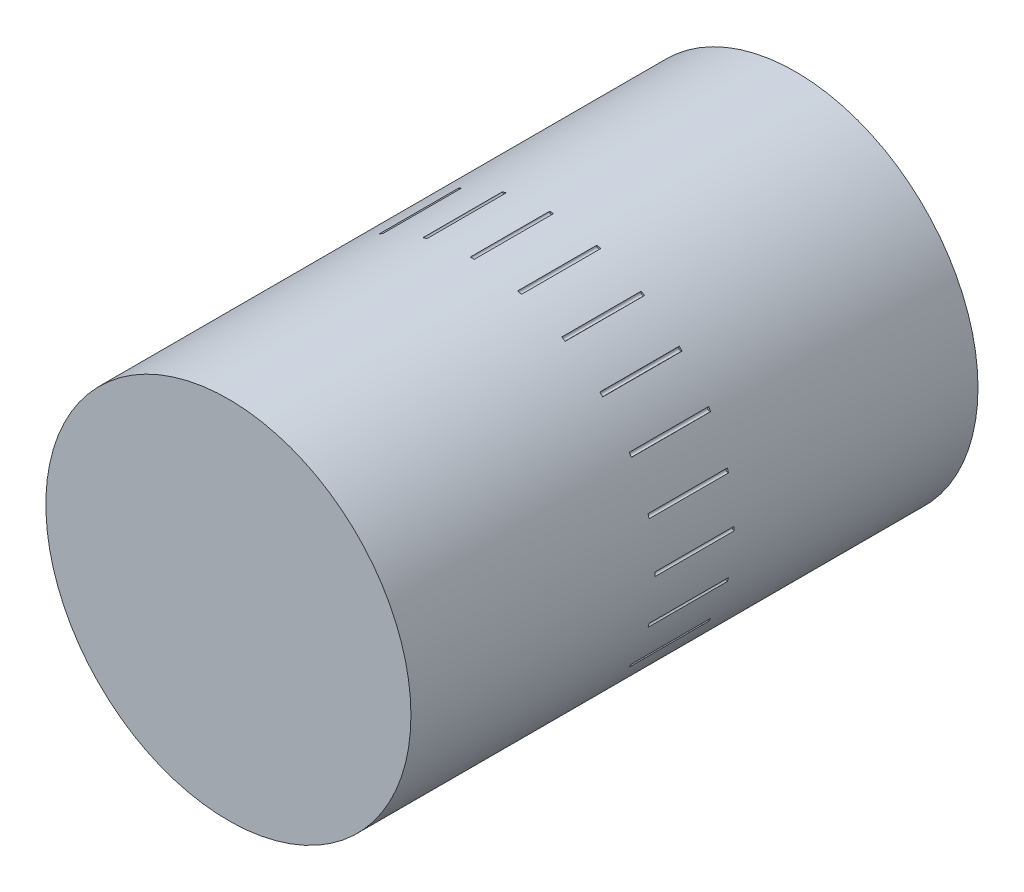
ISO-10303-21;
HEADER;
FILE_DESCRIPTION(('STEP AP214'),'2;1');
FILE_NAME('part.step','',(''),(''),'','','');
FILE_SCHEMA(('AUTOMOTIVE_DESIGN { 1 0 10303 214 1 1 1 1 }'));
ENDSEC;
DATA;
#1=APPLICATION_CONTEXT('core data for automotive mechanical design processes');
#2=APPLICATION_PROTOCOL_DEFINITION('international standard','automotive_design',2000,#1);
#3=PRODUCT_CONTEXT('',#1,'mechanical');
#4=PRODUCT('Part','Part','',(#3));
#5=PRODUCT_RELATED_PRODUCT_CATEGORY('part','',(#4));
#6=PRODUCT_DEFINITION_FORMATION('','',#4);
#7=PRODUCT_DEFINITION_CONTEXT('part definition',#1,'design');
#8=PRODUCT_DEFINITION('design','',#6,#7);
#9=PRODUCT_DEFINITION_SHAPE('','',#8);
#10=(LENGTH_UNIT() NAMED_UNIT(*) SI_UNIT(.MILLI.,.METRE.));
#11=(NAMED_UNIT(*) PLANE_ANGLE_UNIT() SI_UNIT($,.RADIAN.));
#12=(NAMED_UNIT(*) SI_UNIT($,.STERADIAN.) SOLID_ANGLE_UNIT());
#13=UNCERTAINTY_MEASURE_WITH_UNIT(LENGTH_MEASURE(1.E-05),#10,'distance_accuracy_value','');
#14=(GEOMETRIC_REPRESENTATION_CONTEXT(3) GLOBAL_UNCERTAINTY_ASSIGNED_CONTEXT((#13)) GLOBAL_UNIT_ASSIGNED_CONTEXT((#10,
#11,#12)) REPRESENTATION_CONTEXT('',''));
#15=CARTESIAN_POINT('',(0.,0.,0.));
#16=DIRECTION('',(0.,0.,1.));
#17=DIRECTION('',(1.,0.,0.));
#18=AXIS2_PLACEMENT_3D('',#15,#16,#17);
#19=CARTESIAN_POINT('',(0.,0.,35.75));
#20=DIRECTION('',(0.,0.,-1.));
#21=DIRECTION('',(-1.,0.,0.));
#22=AXIS2_PLACEMENT_3D('',#19,#20,#21);
#23=CYLINDRICAL_SURFACE('',#22,23.0164756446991);
#24=CARTESIAN_POINT('',(0.,0.,-5.));
#25=DIRECTION('',(0.,0.,1.));
#26=DIRECTION('',(0.866025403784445,0.499999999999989,0.));
#27=AXIS2_PLACEMENT_3D('',#24,#25,#26);
#28=CIRCLE('',#27,23.0164756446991);
#29=CARTESIAN_POINT('',(-11.2910558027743,20.0566749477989,-5.));
#30=VERTEX_POINT('',#29);
#31=CARTESIAN_POINT('',(-11.7240621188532,19.80667863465,-5.));
#32=VERTEX_POINT('',#31);
#33=EDGE_CURVE('E359',#30,#32,#28,.T.);
#34=ORIENTED_EDGE('',*,*,#33,.F.);
#35=DIRECTION('',(0.,0.,1.));
#36=VECTOR('',#35,1.);
#37=CARTESIAN_POINT('',(-11.2910558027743,20.0566749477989,-5.));
#38=LINE('',#37,#36);
#39=CARTESIAN_POINT('',(-11.2910558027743,20.0566749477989,5.));
#40=VERTEX_POINT('',#39);
#41=EDGE_CURVE('E368',#30,#40,#38,.T.);
#42=ORIENTED_EDGE('',*,*,#41,.T.);
#43=CARTESIAN_POINT('',(0.,0.,5.));
#44=DIRECTION('',(0.,0.,1.));
#45=DIRECTION('',(0.866025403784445,0.499999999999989,0.));
#46=AXIS2_PLACEMENT_3D('',#43,#44,#45);
#47=CIRCLE('',#46,23.0164756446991);
#48=CARTESIAN_POINT('',(-11.7240621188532,19.80667863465,5.));
#49=VERTEX_POINT('',#48);
#50=EDGE_CURVE('E355',#40,#49,#47,.T.);
#51=ORIENTED_EDGE('',*,*,#50,.T.);
#52=DIRECTION('',(0.,0.,1.));
#53=VECTOR('',#52,1.);
#54=CARTESIAN_POINT('',(-11.7240621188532,19.80667863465,-5.));
#55=LINE('',#54,#53);
#56=EDGE_CURVE('E364',#32,#49,#55,.T.);
#57=ORIENTED_EDGE('',*,*,#56,.F.);
#58=EDGE_LOOP('',(#34,#42,#51,#57));
#59=FACE_BOUND('',#58,.T.);
#60=CARTESIAN_POINT('',(0.,0.,-5.));
#61=DIRECTION('',(0.,0.,1.));
#62=DIRECTION('',(0.50000000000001,0.866025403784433,0.));
#63=AXIS2_PLACEMENT_3D('',#60,#61,#62);
#64=CIRCLE('',#63,23.0164756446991);
#65=CARTESIAN_POINT('',(-19.8066786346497,11.7240621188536,-5.));
#66=VERTEX_POINT('',#65);
#67=CARTESIAN_POINT('',(-20.0566749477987,11.2910558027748,-5.));
#68=VERTEX_POINT('',#67);
#69=EDGE_CURVE('E390',#66,#68,#64,.T.);
#70=ORIENTED_EDGE('',*,*,#69,.F.);
#71=DIRECTION('',(0.,0.,1.));
#72=VECTOR('',#71,1.);
#73=CARTESIAN_POINT('',(-19.8066786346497,11.7240621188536,-5.));
#74=LINE('',#73,#72);
#75=CARTESIAN_POINT('',(-19.8066786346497,11.7240621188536,5.));
#76=VERTEX_POINT('',#75);
#77=EDGE_CURVE('E401',#66,#76,#74,.T.);
#78=ORIENTED_EDGE('',*,*,#77,.T.);
#79=CARTESIAN_POINT('',(0.,0.,5.));
#80=DIRECTION('',(0.,0.,1.));
#81=DIRECTION('',(0.50000000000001,0.866025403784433,0.));
#82=AXIS2_PLACEMENT_3D('',#79,#80,#81);
#83=CIRCLE('',#82,23.0164756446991);
#84=CARTESIAN_POINT('',(-20.0566749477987,11.2910558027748,5.));
#85=VERTEX_POINT('',#84);
#86=EDGE_CURVE('E387',#76,#85,#83,.T.);
#87=ORIENTED_EDGE('',*,*,#86,.T.);
#88=DIRECTION('',(0.,0.,1.));
#89=VECTOR('',#88,1.);
#90=CARTESIAN_POINT('',(-20.0566749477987,11.2910558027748,-5.));
#91=LINE('',#90,#89);
#92=EDGE_CURVE('E396',#68,#85,#91,.T.);
#93=ORIENTED_EDGE('',*,*,#92,.F.);
#94=EDGE_LOOP('',(#70,#78,#87,#93));
#95=FACE_BOUND('',#94,.T.);
#96=CARTESIAN_POINT('',(0.,0.,-5.));
#97=DIRECTION('',(0.,0.,1.));
#98=DIRECTION('',(0.,1.,0.));
#99=AXIS2_PLACEMENT_3D('',#96,#97,#98);
#100=CIRCLE('',#99,23.0164756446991);
#101=CARTESIAN_POINT('',(-23.015117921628,0.249996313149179,-5.));
#102=VERTEX_POINT('',#101);
#103=CARTESIAN_POINT('',(-23.015117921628,-0.249996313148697,-5.));
#104=VERTEX_POINT('',#103);
#105=EDGE_CURVE('E424',#102,#104,#100,.T.);
#106=ORIENTED_EDGE('',*,*,#105,.F.);
#107=DIRECTION('',(0.,0.,1.));
#108=VECTOR('',#107,1.);
#109=CARTESIAN_POINT('',(-23.015117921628,0.249996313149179,-5.));
#110=LINE('',#109,#108);
#111=CARTESIAN_POINT('',(-23.015117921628,0.249996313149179,5.));
#112=VERTEX_POINT('',#111);
#113=EDGE_CURVE('E435',#102,#112,#110,.T.);
#114=ORIENTED_EDGE('',*,*,#113,.T.);
#115=CARTESIAN_POINT('',(0.,0.,5.));
#116=DIRECTION('',(0.,0.,1.));
#117=DIRECTION('',(0.,1.,0.));
#118=AXIS2_PLACEMENT_3D('',#115,#116,#117);
#119=CIRCLE('',#118,23.0164756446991);
#120=CARTESIAN_POINT('',(-23.015117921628,-0.249996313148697,5.));
#121=VERTEX_POINT('',#120);
#122=EDGE_CURVE('E421',#112,#121,#119,.T.);
#123=ORIENTED_EDGE('',*,*,#122,.T.);
#124=DIRECTION('',(0.,0.,1.));
#125=VECTOR('',#124,1.);
#126=CARTESIAN_POINT('',(-23.015117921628,-0.249996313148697,-5.));
#127=LINE('',#126,#125);
#128=EDGE_CURVE('E430',#104,#121,#127,.T.);
#129=ORIENTED_EDGE('',*,*,#128,.F.);
#130=EDGE_LOOP('',(#106,#114,#123,#129));
#131=FACE_BOUND('',#130,.T.);
#132=CARTESIAN_POINT('',(0.,0.,-5.));
#133=DIRECTION('',(0.,0.,1.));
#134=DIRECTION('',(-0.499999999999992,0.866025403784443,0.));
#135=AXIS2_PLACEMENT_3D('',#132,#133,#134);
#136=CIRCLE('',#135,23.0164756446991);
#137=CARTESIAN_POINT('',(-20.0566749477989,-11.2910558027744,-5.));
#138=VERTEX_POINT('',#137);
#139=CARTESIAN_POINT('',(-19.80667863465,-11.7240621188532,-5.));
#140=VERTEX_POINT('',#139);
#141=EDGE_CURVE('E458',#138,#140,#136,.T.);
#142=ORIENTED_EDGE('',*,*,#141,.F.);
#143=DIRECTION('',(0.,0.,1.));
#144=VECTOR('',#143,1.);
#145=CARTESIAN_POINT('',(-20.0566749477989,-11.2910558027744,-5.));
#146=LINE('',#145,#144);
#147=CARTESIAN_POINT('',(-20.0566749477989,-11.2910558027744,5.));
#148=VERTEX_POINT('',#147);
#149=EDGE_CURVE('E469',#138,#148,#146,.T.);
#150=ORIENTED_EDGE('',*,*,#149,.T.);
#151=CARTESIAN_POINT('',(0.,0.,5.));
#152=DIRECTION('',(0.,0.,1.));
#153=DIRECTION('',(-0.499999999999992,0.866025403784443,0.));
#154=AXIS2_PLACEMENT_3D('',#151,#152,#153);
#155=CIRCLE('',#154,23.0164756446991);
#156=CARTESIAN_POINT('',(-19.80667863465,-11.7240621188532,5.));
#157=VERTEX_POINT('',#156);
#158=EDGE_CURVE('E455',#148,#157,#155,.T.);
#159=ORIENTED_EDGE('',*,*,#158,.T.);
#160=DIRECTION('',(0.,0.,1.));
#161=VECTOR('',#160,1.);
#162=CARTESIAN_POINT('',(-19.80667863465,-11.7240621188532,-5.));
#163=LINE('',#162,#161);
#164=EDGE_CURVE('E464',#140,#157,#163,.T.);
#165=ORIENTED_EDGE('',*,*,#164,.F.);
#166=EDGE_LOOP('',(#142,#150,#159,#165));
#167=FACE_BOUND('',#166,.T.);
#168=CARTESIAN_POINT('',(0.,0.,-5.));
#169=DIRECTION('',(0.,0.,1.));
#170=DIRECTION('',(-0.866025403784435,0.500000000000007,0.));
#171=AXIS2_PLACEMENT_3D('',#168,#169,#170);
#172=CIRCLE('',#171,23.0164756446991);
#173=CARTESIAN_POINT('',(-11.7240621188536,-19.8066786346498,-5.));
#174=VERTEX_POINT('',#173);
#175=CARTESIAN_POINT('',(-11.2910558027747,-20.0566749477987,-5.));
#176=VERTEX_POINT('',#175);
#177=EDGE_CURVE('E492',#174,#176,#172,.T.);
#178=ORIENTED_EDGE('',*,*,#177,.F.);
#179=DIRECTION('',(0.,0.,1.));
#180=VECTOR('',#179,1.);
#181=CARTESIAN_POINT('',(-11.7240621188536,-19.8066786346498,-5.));
#182=LINE('',#181,#180);
#183=CARTESIAN_POINT('',(-11.7240621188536,-19.8066786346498,5.));
#184=VERTEX_POINT('',#183);
#185=EDGE_CURVE('E503',#174,#184,#182,.T.);
#186=ORIENTED_EDGE('',*,*,#185,.T.);
#187=CARTESIAN_POINT('',(0.,0.,5.));
#188=DIRECTION('',(0.,0.,1.));
#189=DIRECTION('',(-0.866025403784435,0.500000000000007,0.));
#190=AXIS2_PLACEMENT_3D('',#187,#188,#189);
#191=CIRCLE('',#190,23.0164756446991);
#192=CARTESIAN_POINT('',(-11.2910558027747,-20.0566749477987,5.));
#193=VERTEX_POINT('',#192);
#194=EDGE_CURVE('E489',#184,#193,#191,.T.);
#195=ORIENTED_EDGE('',*,*,#194,.T.);
#196=DIRECTION('',(0.,0.,1.));
#197=VECTOR('',#196,1.);
#198=CARTESIAN_POINT('',(-11.2910558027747,-20.0566749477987,-5.));
#199=LINE('',#198,#197);
#200=EDGE_CURVE('E498',#176,#193,#199,.T.);
#201=ORIENTED_EDGE('',*,*,#200,.F.);
#202=EDGE_LOOP('',(#178,#186,#195,#201));
#203=FACE_BOUND('',#202,.T.);
#204=CARTESIAN_POINT('',(0.,0.,-5.));
#205=DIRECTION('',(0.,0.,1.));
#206=DIRECTION('',(-1.,0.,0.));
#207=AXIS2_PLACEMENT_3D('',#204,#205,#206);
#208=CIRCLE('',#207,23.0164756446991);
#209=CARTESIAN_POINT('',(-0.249996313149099,-23.015117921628,-5.));
#210=VERTEX_POINT('',#209);
#211=CARTESIAN_POINT('',(0.249996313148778,-23.015117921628,-5.));
#212=VERTEX_POINT('',#211);
#213=EDGE_CURVE('E526',#210,#212,#208,.T.);
#214=ORIENTED_EDGE('',*,*,#213,.F.);
#215=DIRECTION('',(0.,0.,1.));
#216=VECTOR('',#215,1.);
#217=CARTESIAN_POINT('',(-0.249996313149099,-23.015117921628,-5.));
#218=LINE('',#217,#216);
#219=CARTESIAN_POINT('',(-0.249996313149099,-23.015117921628,5.));
#220=VERTEX_POINT('',#219);
#221=EDGE_CURVE('E537',#210,#220,#218,.T.);
#222=ORIENTED_EDGE('',*,*,#221,.T.);
#223=CARTESIAN_POINT('',(0.,0.,5.));
#224=DIRECTION('',(0.,0.,1.));
#225=DIRECTION('',(-1.,0.,0.));
#226=AXIS2_PLACEMENT_3D('',#223,#224,#225);
#227=CIRCLE('',#226,23.0164756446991);
#228=CARTESIAN_POINT('',(0.249996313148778,-23.015117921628,5.));
#229=VERTEX_POINT('',#228);
#230=EDGE_CURVE('E523',#220,#229,#227,.T.);
#231=ORIENTED_EDGE('',*,*,#230,.T.);
#232=DIRECTION('',(0.,0.,1.));
#233=VECTOR('',#232,1.);
#234=CARTESIAN_POINT('',(0.249996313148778,-23.015117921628,-5.));
#235=LINE('',#234,#233);
#236=EDGE_CURVE('E532',#212,#229,#235,.T.);
#237=ORIENTED_EDGE('',*,*,#236,.F.);
#238=EDGE_LOOP('',(#214,#222,#231,#237));
#239=FACE_BOUND('',#238,.T.);
#240=CARTESIAN_POINT('',(0.,0.,-5.));
#241=DIRECTION('',(0.,0.,1.));
#242=DIRECTION('',(-0.866025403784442,-0.499999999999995,0.));
#243=AXIS2_PLACEMENT_3D('',#240,#241,#242);
#244=CIRCLE('',#243,23.0164756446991);
#245=CARTESIAN_POINT('',(11.2910558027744,-20.0566749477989,-5.));
#246=VERTEX_POINT('',#245);
#247=CARTESIAN_POINT('',(11.7240621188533,-19.8066786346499,-5.));
#248=VERTEX_POINT('',#247);
#249=EDGE_CURVE('E560',#246,#248,#244,.T.);
#250=ORIENTED_EDGE('',*,*,#249,.F.);
#251=DIRECTION('',(0.,0.,1.));
#252=VECTOR('',#251,1.);
#253=CARTESIAN_POINT('',(11.2910558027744,-20.0566749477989,-5.));
#254=LINE('',#253,#252);
#255=CARTESIAN_POINT('',(11.2910558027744,-20.0566749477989,5.));
#256=VERTEX_POINT('',#255);
#257=EDGE_CURVE('E571',#246,#256,#254,.T.);
#258=ORIENTED_EDGE('',*,*,#257,.T.);
#259=CARTESIAN_POINT('',(0.,0.,5.));
#260=DIRECTION('',(0.,0.,1.));
#261=DIRECTION('',(-0.866025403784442,-0.499999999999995,0.));
#262=AXIS2_PLACEMENT_3D('',#259,#260,#261);
#263=CIRCLE('',#262,23.0164756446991);
#264=CARTESIAN_POINT('',(11.7240621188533,-19.8066786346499,5.));
#265=VERTEX_POINT('',#264);
#266=EDGE_CURVE('E557',#256,#265,#263,.T.);
#267=ORIENTED_EDGE('',*,*,#266,.T.);
#268=DIRECTION('',(0.,0.,1.));
#269=VECTOR('',#268,1.);
#270=CARTESIAN_POINT('',(11.7240621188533,-19.8066786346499,-5.));
#271=LINE('',#270,#269);
#272=EDGE_CURVE('E566',#248,#265,#271,.T.);
#273=ORIENTED_EDGE('',*,*,#272,.F.);
#274=EDGE_LOOP('',(#250,#258,#267,#273));
#275=FACE_BOUND('',#274,.T.);
#276=CARTESIAN_POINT('',(0.,0.,-5.));
#277=DIRECTION('',(0.,0.,1.));
#278=DIRECTION('',(-0.500000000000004,-0.866025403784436,0.));
#279=AXIS2_PLACEMENT_3D('',#276,#277,#278);
#280=CIRCLE('',#279,23.0164756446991);
#281=CARTESIAN_POINT('',(19.8066786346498,-11.7240621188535,-5.));
#282=VERTEX_POINT('',#281);
#283=CARTESIAN_POINT('',(20.0566749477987,-11.2910558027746,-5.));
#284=VERTEX_POINT('',#283);
#285=EDGE_CURVE('E594',#282,#284,#280,.T.);
#286=ORIENTED_EDGE('',*,*,#285,.F.);
#287=DIRECTION('',(0.,0.,1.));
#288=VECTOR('',#287,1.);
#289=CARTESIAN_POINT('',(19.8066786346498,-11.7240621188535,-5.));
#290=LINE('',#289,#288);
#291=CARTESIAN_POINT('',(19.8066786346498,-11.7240621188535,5.));
#292=VERTEX_POINT('',#291);
#293=EDGE_CURVE('E605',#282,#292,#290,.T.);
#294=ORIENTED_EDGE('',*,*,#293,.T.);
#295=CARTESIAN_POINT('',(0.,0.,5.));
#296=DIRECTION('',(0.,0.,1.));
#297=DIRECTION('',(-0.500000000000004,-0.866025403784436,0.));
#298=AXIS2_PLACEMENT_3D('',#295,#296,#297);
#299=CIRCLE('',#298,23.0164756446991);
#300=CARTESIAN_POINT('',(20.0566749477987,-11.2910558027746,5.));
#301=VERTEX_POINT('',#300);
#302=EDGE_CURVE('E591',#292,#301,#299,.T.);
#303=ORIENTED_EDGE('',*,*,#302,.T.);
#304=DIRECTION('',(0.,0.,1.));
#305=VECTOR('',#304,1.);
#306=CARTESIAN_POINT('',(20.0566749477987,-11.2910558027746,-5.));
#307=LINE('',#306,#305);
#308=EDGE_CURVE('E600',#284,#301,#307,.T.);
#309=ORIENTED_EDGE('',*,*,#308,.F.);
#310=EDGE_LOOP('',(#286,#294,#303,#309));
#311=FACE_BOUND('',#310,.T.);
#312=CARTESIAN_POINT('',(0.,0.,-5.));
#313=DIRECTION('',(0.,0.,1.));
#314=DIRECTION('',(0.,-1.,0.));
#315=AXIS2_PLACEMENT_3D('',#312,#313,#314);
#316=CIRCLE('',#315,23.0164756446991);
#317=CARTESIAN_POINT('',(23.015117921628,-0.249996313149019,-5.));
#318=VERTEX_POINT('',#317);
#319=CARTESIAN_POINT('',(23.015117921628,0.249996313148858,-5.));
#320=VERTEX_POINT('',#319);
#321=EDGE_CURVE('E628',#318,#320,#316,.T.);
#322=ORIENTED_EDGE('',*,*,#321,.F.);
#323=DIRECTION('',(0.,0.,1.));
#324=VECTOR('',#323,1.);
#325=CARTESIAN_POINT('',(23.015117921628,-0.249996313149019,-5.));
#326=LINE('',#325,#324);
#327=CARTESIAN_POINT('',(23.015117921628,-0.249996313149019,5.));
#328=VERTEX_POINT('',#327);
#329=EDGE_CURVE('E639',#318,#328,#326,.T.);
#330=ORIENTED_EDGE('',*,*,#329,.T.);
#331=CARTESIAN_POINT('',(0.,0.,5.));
#332=DIRECTION('',(0.,0.,1.));
#333=DIRECTION('',(0.,-1.,0.));
#334=AXIS2_PLACEMENT_3D('',#331,#332,#333);
#335=CIRCLE('',#334,23.0164756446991);
#336=CARTESIAN_POINT('',(23.015117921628,0.249996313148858,5.));
#337=VERTEX_POINT('',#336);
#338=EDGE_CURVE('E625',#328,#337,#335,.T.);
#339=ORIENTED_EDGE('',*,*,#338,.T.);
#340=DIRECTION('',(0.,0.,1.));
#341=VECTOR('',#340,1.);
#342=CARTESIAN_POINT('',(23.015117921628,0.249996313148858,-5.));
#343=LINE('',#342,#341);
#344=EDGE_CURVE('E634',#320,#337,#343,.T.);
#345=ORIENTED_EDGE('',*,*,#344,.F.);
#346=EDGE_LOOP('',(#322,#330,#339,#345));
#347=FACE_BOUND('',#346,.T.);
#348=CARTESIAN_POINT('',(0.,0.,-5.));
#349=DIRECTION('',(0.,0.,1.));
#350=DIRECTION('',(0.499999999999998,-0.86602540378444,0.));
#351=AXIS2_PLACEMENT_3D('',#348,#349,#350);
#352=CIRCLE('',#351,23.0164756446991);
#353=CARTESIAN_POINT('',(20.0566749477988,11.2910558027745,-5.));
#354=VERTEX_POINT('',#353);
#355=CARTESIAN_POINT('',(19.8066786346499,11.7240621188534,-5.));
#356=VERTEX_POINT('',#355);
#357=EDGE_CURVE('E662',#354,#356,#352,.T.);
#358=ORIENTED_EDGE('',*,*,#357,.F.);
#359=DIRECTION('',(0.,0.,1.));
#360=VECTOR('',#359,1.);
#361=CARTESIAN_POINT('',(20.0566749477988,11.2910558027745,-5.));
#362=LINE('',#361,#360);
#363=CARTESIAN_POINT('',(20.0566749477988,11.2910558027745,5.));
#364=VERTEX_POINT('',#363);
#365=EDGE_CURVE('E673',#354,#364,#362,.T.);
#366=ORIENTED_EDGE('',*,*,#365,.T.);
#367=CARTESIAN_POINT('',(0.,0.,5.));
#368=DIRECTION('',(0.,0.,1.));
#369=DIRECTION('',(0.499999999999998,-0.86602540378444,0.));
#370=AXIS2_PLACEMENT_3D('',#367,#368,#369);
#371=CIRCLE('',#370,23.0164756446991);
#372=CARTESIAN_POINT('',(19.8066786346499,11.7240621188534,5.));
#373=VERTEX_POINT('',#372);
#374=EDGE_CURVE('E659',#364,#373,#371,.T.);
#375=ORIENTED_EDGE('',*,*,#374,.T.);
#376=DIRECTION('',(0.,0.,1.));
#377=VECTOR('',#376,1.);
#378=CARTESIAN_POINT('',(19.8066786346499,11.7240621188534,-5.));
#379=LINE('',#378,#377);
#380=EDGE_CURVE('E668',#356,#373,#379,.T.);
#381=ORIENTED_EDGE('',*,*,#380,.F.);
#382=EDGE_LOOP('',(#358,#366,#375,#381));
#383=FACE_BOUND('',#382,.T.);
#384=CARTESIAN_POINT('',(0.,0.,-5.));
#385=DIRECTION('',(0.,0.,1.));
#386=DIRECTION('',(0.866025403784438,-0.500000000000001,0.));
#387=AXIS2_PLACEMENT_3D('',#384,#385,#386);
#388=CIRCLE('',#387,23.0164756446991);
#389=CARTESIAN_POINT('',(11.7240621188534,19.8066786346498,-5.));
#390=VERTEX_POINT('',#389);
#391=CARTESIAN_POINT('',(11.2910558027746,20.0566749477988,-5.));
#392=VERTEX_POINT('',#391);
#393=EDGE_CURVE('E696',#390,#392,#388,.T.);
#394=ORIENTED_EDGE('',*,*,#393,.F.);
#395=DIRECTION('',(0.,0.,1.));
#396=VECTOR('',#395,1.);
#397=CARTESIAN_POINT('',(11.7240621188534,19.8066786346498,-5.));
#398=LINE('',#397,#396);
#399=CARTESIAN_POINT('',(11.7240621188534,19.8066786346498,5.));
#400=VERTEX_POINT('',#399);
#401=EDGE_CURVE('E707',#390,#400,#398,.T.);
#402=ORIENTED_EDGE('',*,*,#401,.T.);
#403=CARTESIAN_POINT('',(0.,0.,5.));
#404=DIRECTION('',(0.,0.,1.));
#405=DIRECTION('',(0.866025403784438,-0.500000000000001,0.));
#406=AXIS2_PLACEMENT_3D('',#403,#404,#405);
#407=CIRCLE('',#406,23.0164756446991);
#408=CARTESIAN_POINT('',(11.2910558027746,20.0566749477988,5.));
#409=VERTEX_POINT('',#408);
#410=EDGE_CURVE('E693',#400,#409,#407,.T.);
#411=ORIENTED_EDGE('',*,*,#410,.T.);
#412=DIRECTION('',(0.,0.,1.));
#413=VECTOR('',#412,1.);
#414=CARTESIAN_POINT('',(11.2910558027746,20.0566749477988,-5.));
#415=LINE('',#414,#413);
#416=EDGE_CURVE('E702',#392,#409,#415,.T.);
#417=ORIENTED_EDGE('',*,*,#416,.F.);
#418=EDGE_LOOP('',(#394,#402,#411,#417));
#419=FACE_BOUND('',#418,.T.);
#420=CARTESIAN_POINT('',(0.,0.,-5.));
#421=DIRECTION('',(0.,0.,1.));
#422=DIRECTION('',(1.,0.,0.));
#423=AXIS2_PLACEMENT_3D('',#420,#421,#422);
#424=CIRCLE('',#423,23.0164756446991);
#425=CARTESIAN_POINT('',(0.249996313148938,23.015117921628,-5.));
#426=VERTEX_POINT('',#425);
#427=CARTESIAN_POINT('',(-0.249996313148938,23.015117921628,-5.));
#428=VERTEX_POINT('',#427);
#429=EDGE_CURVE('E730',#426,#428,#424,.T.);
#430=ORIENTED_EDGE('',*,*,#429,.F.);
#431=DIRECTION('',(0.,0.,1.));
#432=VECTOR('',#431,1.);
#433=CARTESIAN_POINT('',(0.249996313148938,23.015117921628,-5.));
#434=LINE('',#433,#432);
#435=CARTESIAN_POINT('',(0.249996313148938,23.015117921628,5.));
#436=VERTEX_POINT('',#435);
#437=EDGE_CURVE('E741',#426,#436,#434,.T.);
#438=ORIENTED_EDGE('',*,*,#437,.T.);
#439=CARTESIAN_POINT('',(0.,0.,5.));
#440=DIRECTION('',(0.,0.,1.));
#441=DIRECTION('',(1.,0.,0.));
#442=AXIS2_PLACEMENT_3D('',#439,#440,#441);
#443=CIRCLE('',#442,23.0164756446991);
#444=CARTESIAN_POINT('',(-0.249996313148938,23.015117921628,5.));
#445=VERTEX_POINT('',#444);
#446=EDGE_CURVE('E727',#436,#445,#443,.T.);
#447=ORIENTED_EDGE('',*,*,#446,.T.);
#448=DIRECTION('',(0.,0.,1.));
#449=VECTOR('',#448,1.);
#450=CARTESIAN_POINT('',(-0.249996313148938,23.015117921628,-5.));
#451=LINE('',#450,#449);
#452=EDGE_CURVE('E736',#428,#445,#451,.T.);
#453=ORIENTED_EDGE('',*,*,#452,.F.);
#454=EDGE_LOOP('',(#430,#438,#447,#453));
#455=FACE_BOUND('',#454,.T.);
#456=CARTESIAN_POINT('',(0.,0.,35.75));
#457=DIRECTION('',(0.,0.,1.));
#458=DIRECTION('',(1.,0.,0.));
#459=AXIS2_PLACEMENT_3D('',#456,#457,#458);
#460=CIRCLE('',#459,23.0164756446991);
#461=CARTESIAN_POINT('',(23.0164756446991,0.,35.75));
#462=VERTEX_POINT('',#461);
#463=EDGE_CURVE('E11',#462,#462,#460,.T.);
#464=ORIENTED_EDGE('',*,*,#463,.F.);
#465=EDGE_LOOP('',(#464));
#466=FACE_BOUND('',#465,.T.);
#467=CARTESIAN_POINT('',(0.,0.,-35.75));
#468=DIRECTION('',(0.,0.,1.));
#469=DIRECTION('',(1.,0.,0.));
#470=AXIS2_PLACEMENT_3D('',#467,#468,#469);
#471=CIRCLE('',#470,23.0164756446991);
#472=CARTESIAN_POINT('',(23.0164756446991,0.,-35.75));
#473=VERTEX_POINT('',#472);
#474=EDGE_CURVE('E38',#473,#473,#471,.T.);
#475=ORIENTED_EDGE('',*,*,#474,.T.);
#476=EDGE_LOOP('',(#475));
#477=FACE_BOUND('',#476,.T.);
#478=CARTESIAN_POINT('',(0.,0.,-5.));
#479=DIRECTION('',(0.,0.,1.));
#480=DIRECTION('',(0.965925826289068,-0.258819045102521,0.));
#481=AXIS2_PLACEMENT_3D('',#478,#479,#480);
#482=CIRCLE('',#481,23.0164756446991);
#483=CARTESIAN_POINT('',(6.19822873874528,22.1661929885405,-5.));
#484=VERTEX_POINT('',#483);
#485=CARTESIAN_POINT('',(5.71527294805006,22.2956006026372,-5.));
#486=VERTEX_POINT('',#485);
#487=EDGE_CURVE('E713',#484,#486,#482,.T.);
#488=ORIENTED_EDGE('',*,*,#487,.F.);
#489=DIRECTION('',(0.,0.,1.));
#490=VECTOR('',#489,1.);
#491=CARTESIAN_POINT('',(6.19822873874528,22.1661929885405,-5.));
#492=LINE('',#491,#490);
#493=CARTESIAN_POINT('',(6.19822873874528,22.1661929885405,5.));
#494=VERTEX_POINT('',#493);
#495=EDGE_CURVE('E724',#484,#494,#492,.T.);
#496=ORIENTED_EDGE('',*,*,#495,.T.);
#497=CARTESIAN_POINT('',(0.,0.,5.));
#498=DIRECTION('',(0.,0.,1.));
#499=DIRECTION('',(0.965925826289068,-0.258819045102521,0.));
#500=AXIS2_PLACEMENT_3D('',#497,#498,#499);
#501=CIRCLE('',#500,23.0164756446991);
#502=CARTESIAN_POINT('',(5.71527294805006,22.2956006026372,5.));
#503=VERTEX_POINT('',#502);
#504=EDGE_CURVE('E710',#494,#503,#501,.T.);
#505=ORIENTED_EDGE('',*,*,#504,.T.);
#506=DIRECTION('',(0.,0.,1.));
#507=VECTOR('',#506,1.);
#508=CARTESIAN_POINT('',(5.71527294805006,22.2956006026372,-5.));
#509=LINE('',#508,#507);
#510=EDGE_CURVE('E719',#486,#503,#509,.T.);
#511=ORIENTED_EDGE('',*,*,#510,.F.);
#512=EDGE_LOOP('',(#488,#496,#505,#511));
#513=FACE_BOUND('',#512,.T.);
#514=CARTESIAN_POINT('',(0.,0.,-5.));
#515=DIRECTION('',(0.,0.,1.));
#516=DIRECTION('',(0.707106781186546,-0.707106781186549,0.));
#517=AXIS2_PLACEMENT_3D('',#514,#515,#516);
#518=CIRCLE('',#517,23.0164756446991);
#519=CARTESIAN_POINT('',(16.4509200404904,16.0973718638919,-5.));
#520=VERTEX_POINT('',#519);
#521=CARTESIAN_POINT('',(16.097371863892,16.4509200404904,-5.));
#522=VERTEX_POINT('',#521);
#523=EDGE_CURVE('E679',#520,#522,#518,.T.);
#524=ORIENTED_EDGE('',*,*,#523,.F.);
#525=DIRECTION('',(0.,0.,1.));
#526=VECTOR('',#525,1.);
#527=CARTESIAN_POINT('',(16.4509200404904,16.0973718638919,-5.));
#528=LINE('',#527,#526);
#529=CARTESIAN_POINT('',(16.4509200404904,16.0973718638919,5.));
#530=VERTEX_POINT('',#529);
#531=EDGE_CURVE('E690',#520,#530,#528,.T.);
#532=ORIENTED_EDGE('',*,*,#531,.T.);
#533=CARTESIAN_POINT('',(0.,0.,5.));
#534=DIRECTION('',(0.,0.,1.));
#535=DIRECTION('',(0.707106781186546,-0.707106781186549,0.));
#536=AXIS2_PLACEMENT_3D('',#533,#534,#535);
#537=CIRCLE('',#536,23.0164756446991);
#538=CARTESIAN_POINT('',(16.097371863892,16.4509200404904,5.));
#539=VERTEX_POINT('',#538);
#540=EDGE_CURVE('E676',#530,#539,#537,.T.);
#541=ORIENTED_EDGE('',*,*,#540,.T.);
#542=DIRECTION('',(0.,0.,1.));
#543=VECTOR('',#542,1.);
#544=CARTESIAN_POINT('',(16.097371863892,16.4509200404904,-5.));
#545=LINE('',#544,#543);
#546=EDGE_CURVE('E685',#522,#539,#545,.T.);
#547=ORIENTED_EDGE('',*,*,#546,.F.);
#548=EDGE_LOOP('',(#524,#532,#541,#547));
#549=FACE_BOUND('',#548,.T.);
#550=CARTESIAN_POINT('',(0.,0.,-5.));
#551=DIRECTION('',(0.,0.,1.));
#552=DIRECTION('',(0.258819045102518,-0.965925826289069,0.));
#553=AXIS2_PLACEMENT_3D('',#550,#551,#552);
#554=CIRCLE('',#553,23.0164756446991);
#555=CARTESIAN_POINT('',(22.2956006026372,5.71527294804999,-5.));
#556=VERTEX_POINT('',#555);
#557=CARTESIAN_POINT('',(22.1661929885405,6.19822873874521,-5.));
#558=VERTEX_POINT('',#557);
#559=EDGE_CURVE('E645',#556,#558,#554,.T.);
#560=ORIENTED_EDGE('',*,*,#559,.F.);
#561=DIRECTION('',(0.,0.,1.));
#562=VECTOR('',#561,1.);
#563=CARTESIAN_POINT('',(22.2956006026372,5.71527294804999,-5.));
#564=LINE('',#563,#562);
#565=CARTESIAN_POINT('',(22.2956006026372,5.71527294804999,5.));
#566=VERTEX_POINT('',#565);
#567=EDGE_CURVE('E656',#556,#566,#564,.T.);
#568=ORIENTED_EDGE('',*,*,#567,.T.);
#569=CARTESIAN_POINT('',(0.,0.,5.));
#570=DIRECTION('',(0.,0.,1.));
#571=DIRECTION('',(0.258819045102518,-0.965925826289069,0.));
#572=AXIS2_PLACEMENT_3D('',#569,#570,#571);
#573=CIRCLE('',#572,23.0164756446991);
#574=CARTESIAN_POINT('',(22.1661929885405,6.1982287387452,5.));
#575=VERTEX_POINT('',#574);
#576=EDGE_CURVE('E642',#566,#575,#573,.T.);
#577=ORIENTED_EDGE('',*,*,#576,.T.);
#578=DIRECTION('',(0.,0.,1.));
#579=VECTOR('',#578,1.);
#580=CARTESIAN_POINT('',(22.1661929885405,6.19822873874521,-5.));
#581=LINE('',#580,#579);
#582=EDGE_CURVE('E651',#558,#575,#581,.T.);
#583=ORIENTED_EDGE('',*,*,#582,.F.);
#584=EDGE_LOOP('',(#560,#568,#577,#583));
#585=FACE_BOUND('',#584,.T.);
#586=CARTESIAN_POINT('',(0.,0.,-5.));
#587=DIRECTION('',(0.,0.,1.));
#588=DIRECTION('',(-0.258819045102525,-0.965925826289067,0.));
#589=AXIS2_PLACEMENT_3D('',#586,#587,#588);
#590=CIRCLE('',#589,23.0164756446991);
#591=CARTESIAN_POINT('',(22.1661929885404,-6.19822873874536,-5.));
#592=VERTEX_POINT('',#591);
#593=CARTESIAN_POINT('',(22.2956006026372,-5.71527294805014,-5.));
#594=VERTEX_POINT('',#593);
#595=EDGE_CURVE('E611',#592,#594,#590,.T.);
#596=ORIENTED_EDGE('',*,*,#595,.F.);
#597=DIRECTION('',(0.,0.,1.));
#598=VECTOR('',#597,1.);
#599=CARTESIAN_POINT('',(22.1661929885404,-6.19822873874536,-5.));
#600=LINE('',#599,#598);
#601=CARTESIAN_POINT('',(22.1661929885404,-6.19822873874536,5.));
#602=VERTEX_POINT('',#601);
#603=EDGE_CURVE('E622',#592,#602,#600,.T.);
#604=ORIENTED_EDGE('',*,*,#603,.T.);
#605=CARTESIAN_POINT('',(0.,0.,5.));
#606=DIRECTION('',(0.,0.,1.));
#607=DIRECTION('',(-0.258819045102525,-0.965925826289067,0.));
#608=AXIS2_PLACEMENT_3D('',#605,#606,#607);
#609=CIRCLE('',#608,23.0164756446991);
#610=CARTESIAN_POINT('',(22.2956006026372,-5.71527294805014,5.));
#611=VERTEX_POINT('',#610);
#612=EDGE_CURVE('E608',#602,#611,#609,.T.);
#613=ORIENTED_EDGE('',*,*,#612,.T.);
#614=DIRECTION('',(0.,0.,1.));
#615=VECTOR('',#614,1.);
#616=CARTESIAN_POINT('',(22.2956006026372,-5.71527294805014,-5.));
#617=LINE('',#616,#615);
#618=EDGE_CURVE('E617',#594,#611,#617,.T.);
#619=ORIENTED_EDGE('',*,*,#618,.F.);
#620=EDGE_LOOP('',(#596,#604,#613,#619));
#621=FACE_BOUND('',#620,.T.);
#622=CARTESIAN_POINT('',(0.,0.,-5.));
#623=DIRECTION('',(0.,0.,1.));
#624=DIRECTION('',(-0.707106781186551,-0.707106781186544,0.));
#625=AXIS2_PLACEMENT_3D('',#622,#623,#624);
#626=CIRCLE('',#625,23.0164756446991);
#627=CARTESIAN_POINT('',(16.0973718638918,-16.4509200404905,-5.));
#628=VERTEX_POINT('',#627);
#629=CARTESIAN_POINT('',(16.4509200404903,-16.097371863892,-5.));
#630=VERTEX_POINT('',#629);
#631=EDGE_CURVE('E577',#628,#630,#626,.T.);
#632=ORIENTED_EDGE('',*,*,#631,.F.);
#633=DIRECTION('',(0.,0.,1.));
#634=VECTOR('',#633,1.);
#635=CARTESIAN_POINT('',(16.0973718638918,-16.4509200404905,-5.));
#636=LINE('',#635,#634);
#637=CARTESIAN_POINT('',(16.0973718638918,-16.4509200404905,5.));
#638=VERTEX_POINT('',#637);
#639=EDGE_CURVE('E588',#628,#638,#636,.T.);
#640=ORIENTED_EDGE('',*,*,#639,.T.);
#641=CARTESIAN_POINT('',(0.,0.,5.));
#642=DIRECTION('',(0.,0.,1.));
#643=DIRECTION('',(-0.707106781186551,-0.707106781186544,0.));
#644=AXIS2_PLACEMENT_3D('',#641,#642,#643);
#645=CIRCLE('',#644,23.0164756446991);
#646=CARTESIAN_POINT('',(16.4509200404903,-16.097371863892,5.));
#647=VERTEX_POINT('',#646);
#648=EDGE_CURVE('E574',#638,#647,#645,.T.);
#649=ORIENTED_EDGE('',*,*,#648,.T.);
#650=DIRECTION('',(0.,0.,1.));
#651=VECTOR('',#650,1.);
#652=CARTESIAN_POINT('',(16.4509200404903,-16.097371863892,-5.));
#653=LINE('',#652,#651);
#654=EDGE_CURVE('E583',#630,#647,#653,.T.);
#655=ORIENTED_EDGE('',*,*,#654,.F.);
#656=EDGE_LOOP('',(#632,#640,#649,#655));
#657=FACE_BOUND('',#656,.T.);
#658=CARTESIAN_POINT('',(0.,0.,-5.));
#659=DIRECTION('',(0.,0.,1.));
#660=DIRECTION('',(-0.96592582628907,-0.258819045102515,0.));
#661=AXIS2_PLACEMENT_3D('',#658,#659,#660);
#662=CIRCLE('',#661,23.0164756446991);
#663=CARTESIAN_POINT('',(5.71527294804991,-22.2956006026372,-5.));
#664=VERTEX_POINT('',#663);
#665=CARTESIAN_POINT('',(6.19822873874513,-22.1661929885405,-5.));
#666=VERTEX_POINT('',#665);
#667=EDGE_CURVE('E543',#664,#666,#662,.T.);
#668=ORIENTED_EDGE('',*,*,#667,.F.);
#669=DIRECTION('',(0.,0.,1.));
#670=VECTOR('',#669,1.);
#671=CARTESIAN_POINT('',(5.71527294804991,-22.2956006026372,-5.));
#672=LINE('',#671,#670);
#673=CARTESIAN_POINT('',(5.71527294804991,-22.2956006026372,5.));
#674=VERTEX_POINT('',#673);
#675=EDGE_CURVE('E554',#664,#674,#672,.T.);
#676=ORIENTED_EDGE('',*,*,#675,.T.);
#677=CARTESIAN_POINT('',(0.,0.,5.));
#678=DIRECTION('',(0.,0.,1.));
#679=DIRECTION('',(-0.96592582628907,-0.258819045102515,0.));
#680=AXIS2_PLACEMENT_3D('',#677,#678,#679);
#681=CIRCLE('',#680,23.0164756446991);
#682=CARTESIAN_POINT('',(6.19822873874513,-22.1661929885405,5.));
#683=VERTEX_POINT('',#682);
#684=EDGE_CURVE('E540',#674,#683,#681,.T.);
#685=ORIENTED_EDGE('',*,*,#684,.T.);
#686=DIRECTION('',(0.,0.,1.));
#687=VECTOR('',#686,1.);
#688=CARTESIAN_POINT('',(6.19822873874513,-22.1661929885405,-5.));
#689=LINE('',#688,#687);
#690=EDGE_CURVE('E549',#666,#683,#689,.T.);
#691=ORIENTED_EDGE('',*,*,#690,.F.);
#692=EDGE_LOOP('',(#668,#676,#685,#691));
#693=FACE_BOUND('',#692,.T.);
#694=CARTESIAN_POINT('',(0.,0.,-5.));
#695=DIRECTION('',(0.,0.,1.));
#696=DIRECTION('',(-0.965925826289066,0.258819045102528,0.));
#697=AXIS2_PLACEMENT_3D('',#694,#695,#696);
#698=CIRCLE('',#697,23.0164756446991);
#699=CARTESIAN_POINT('',(-6.19822873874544,-22.1661929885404,-5.));
#700=VERTEX_POINT('',#699);
#701=CARTESIAN_POINT('',(-5.71527294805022,-22.2956006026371,-5.));
#702=VERTEX_POINT('',#701);
#703=EDGE_CURVE('E509',#700,#702,#698,.T.);
#704=ORIENTED_EDGE('',*,*,#703,.F.);
#705=DIRECTION('',(0.,0.,1.));
#706=VECTOR('',#705,1.);
#707=CARTESIAN_POINT('',(-6.19822873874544,-22.1661929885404,-5.));
#708=LINE('',#707,#706);
#709=CARTESIAN_POINT('',(-6.19822873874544,-22.1661929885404,5.));
#710=VERTEX_POINT('',#709);
#711=EDGE_CURVE('E520',#700,#710,#708,.T.);
#712=ORIENTED_EDGE('',*,*,#711,.T.);
#713=CARTESIAN_POINT('',(0.,0.,5.));
#714=DIRECTION('',(0.,0.,1.));
#715=DIRECTION('',(-0.965925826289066,0.258819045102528,0.));
#716=AXIS2_PLACEMENT_3D('',#713,#714,#715);
#717=CIRCLE('',#716,23.0164756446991);
#718=CARTESIAN_POINT('',(-5.71527294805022,-22.2956006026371,5.));
#719=VERTEX_POINT('',#718);
#720=EDGE_CURVE('E506',#710,#719,#717,.T.);
#721=ORIENTED_EDGE('',*,*,#720,.T.);
#722=DIRECTION('',(0.,0.,1.));
#723=VECTOR('',#722,1.);
#724=CARTESIAN_POINT('',(-5.71527294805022,-22.2956006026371,-5.));
#725=LINE('',#724,#723);
#726=EDGE_CURVE('E515',#702,#719,#725,.T.);
#727=ORIENTED_EDGE('',*,*,#726,.F.);
#728=EDGE_LOOP('',(#704,#712,#721,#727));
#729=FACE_BOUND('',#728,.T.);
#730=CARTESIAN_POINT('',(0.,0.,-5.));
#731=DIRECTION('',(0.,0.,1.));
#732=DIRECTION('',(-0.707106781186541,0.707106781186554,0.));
#733=AXIS2_PLACEMENT_3D('',#730,#731,#732);
#734=CIRCLE('',#733,23.0164756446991);
#735=CARTESIAN_POINT('',(-16.4509200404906,-16.0973718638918,-5.));
#736=VERTEX_POINT('',#735);
#737=CARTESIAN_POINT('',(-16.0973718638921,-16.4509200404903,-5.));
#738=VERTEX_POINT('',#737);
#739=EDGE_CURVE('E475',#736,#738,#734,.T.);
#740=ORIENTED_EDGE('',*,*,#739,.F.);
#741=DIRECTION('',(0.,0.,1.));
#742=VECTOR('',#741,1.);
#743=CARTESIAN_POINT('',(-16.4509200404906,-16.0973718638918,-5.));
#744=LINE('',#743,#742);
#745=CARTESIAN_POINT('',(-16.4509200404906,-16.0973718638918,5.));
#746=VERTEX_POINT('',#745);
#747=EDGE_CURVE('E486',#736,#746,#744,.T.);
#748=ORIENTED_EDGE('',*,*,#747,.T.);
#749=CARTESIAN_POINT('',(0.,0.,5.));
#750=DIRECTION('',(0.,0.,1.));
#751=DIRECTION('',(-0.707106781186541,0.707106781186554,0.));
#752=AXIS2_PLACEMENT_3D('',#749,#750,#751);
#753=CIRCLE('',#752,23.0164756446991);
#754=CARTESIAN_POINT('',(-16.0973718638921,-16.4509200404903,5.));
#755=VERTEX_POINT('',#754);
#756=EDGE_CURVE('E472',#746,#755,#753,.T.);
#757=ORIENTED_EDGE('',*,*,#756,.T.);
#758=DIRECTION('',(0.,0.,1.));
#759=VECTOR('',#758,1.);
#760=CARTESIAN_POINT('',(-16.0973718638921,-16.4509200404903,-5.));
#761=LINE('',#760,#759);
#762=EDGE_CURVE('E481',#738,#755,#761,.T.);
#763=ORIENTED_EDGE('',*,*,#762,.F.);
#764=EDGE_LOOP('',(#740,#748,#757,#763));
#765=FACE_BOUND('',#764,.T.);
#766=CARTESIAN_POINT('',(0.,0.,-5.));
#767=DIRECTION('',(0.,0.,1.));
#768=DIRECTION('',(-0.258819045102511,0.965925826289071,0.));
#769=AXIS2_PLACEMENT_3D('',#766,#767,#768);
#770=CIRCLE('',#769,23.0164756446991);
#771=CARTESIAN_POINT('',(-22.2956006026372,-5.71527294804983,-5.));
#772=VERTEX_POINT('',#771);
#773=CARTESIAN_POINT('',(-22.1661929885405,-6.19822873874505,-5.));
#774=VERTEX_POINT('',#773);
#775=EDGE_CURVE('E441',#772,#774,#770,.T.);
#776=ORIENTED_EDGE('',*,*,#775,.F.);
#777=DIRECTION('',(0.,0.,1.));
#778=VECTOR('',#777,1.);
#779=CARTESIAN_POINT('',(-22.2956006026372,-5.71527294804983,-5.));
#780=LINE('',#779,#778);
#781=CARTESIAN_POINT('',(-22.2956006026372,-5.71527294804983,5.));
#782=VERTEX_POINT('',#781);
#783=EDGE_CURVE('E452',#772,#782,#780,.T.);
#784=ORIENTED_EDGE('',*,*,#783,.T.);
#785=CARTESIAN_POINT('',(0.,0.,5.));
#786=DIRECTION('',(0.,0.,1.));
#787=DIRECTION('',(-0.258819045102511,0.965925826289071,0.));
#788=AXIS2_PLACEMENT_3D('',#785,#786,#787);
#789=CIRCLE('',#788,23.0164756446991);
#790=CARTESIAN_POINT('',(-22.1661929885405,-6.19822873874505,5.));
#791=VERTEX_POINT('',#790);
#792=EDGE_CURVE('E438',#782,#791,#789,.T.);
#793=ORIENTED_EDGE('',*,*,#792,.T.);
#794=DIRECTION('',(0.,0.,1.));
#795=VECTOR('',#794,1.);
#796=CARTESIAN_POINT('',(-22.1661929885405,-6.19822873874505,-5.));
#797=LINE('',#796,#795);
#798=EDGE_CURVE('E447',#774,#791,#797,.T.);
#799=ORIENTED_EDGE('',*,*,#798,.F.);
#800=EDGE_LOOP('',(#776,#784,#793,#799));
#801=FACE_BOUND('',#800,.T.);
#802=CARTESIAN_POINT('',(0.,0.,-5.));
#803=DIRECTION('',(0.,0.,1.));
#804=DIRECTION('',(0.258819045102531,0.965925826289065,0.));
#805=AXIS2_PLACEMENT_3D('',#802,#803,#804);
#806=CIRCLE('',#805,23.0164756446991);
#807=CARTESIAN_POINT('',(-22.1661929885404,6.19822873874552,-5.));
#808=VERTEX_POINT('',#807);
#809=CARTESIAN_POINT('',(-22.2956006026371,5.7152729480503,-5.));
#810=VERTEX_POINT('',#809);
#811=EDGE_CURVE('E407',#808,#810,#806,.T.);
#812=ORIENTED_EDGE('',*,*,#811,.F.);
#813=DIRECTION('',(0.,0.,1.));
#814=VECTOR('',#813,1.);
#815=CARTESIAN_POINT('',(-22.1661929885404,6.19822873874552,-5.));
#816=LINE('',#815,#814);
#817=CARTESIAN_POINT('',(-22.1661929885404,6.19822873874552,5.));
#818=VERTEX_POINT('',#817);
#819=EDGE_CURVE('E418',#808,#818,#816,.T.);
#820=ORIENTED_EDGE('',*,*,#819,.T.);
#821=CARTESIAN_POINT('',(0.,0.,5.));
#822=DIRECTION('',(0.,0.,1.));
#823=DIRECTION('',(0.258819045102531,0.965925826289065,0.));
#824=AXIS2_PLACEMENT_3D('',#821,#822,#823);
#825=CIRCLE('',#824,23.0164756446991);
#826=CARTESIAN_POINT('',(-22.2956006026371,5.7152729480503,5.));
#827=VERTEX_POINT('',#826);
#828=EDGE_CURVE('E404',#818,#827,#825,.T.);
#829=ORIENTED_EDGE('',*,*,#828,.T.);
#830=DIRECTION('',(0.,0.,1.));
#831=VECTOR('',#830,1.);
#832=CARTESIAN_POINT('',(-22.2956006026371,5.7152729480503,-5.));
#833=LINE('',#832,#831);
#834=EDGE_CURVE('E413',#810,#827,#833,.T.);
#835=ORIENTED_EDGE('',*,*,#834,.F.);
#836=EDGE_LOOP('',(#812,#820,#829,#835));
#837=FACE_BOUND('',#836,.T.);
#838=CARTESIAN_POINT('',(0.,0.,-5.));
#839=DIRECTION('',(0.,0.,1.));
#840=DIRECTION('',(0.707106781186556,0.707106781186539,0.));
#841=AXIS2_PLACEMENT_3D('',#838,#839,#840);
#842=CIRCLE('',#841,23.0164756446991);
#843=CARTESIAN_POINT('',(-16.0973718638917,16.4509200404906,-5.));
#844=VERTEX_POINT('',#843);
#845=CARTESIAN_POINT('',(-16.4509200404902,16.0973718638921,-5.));
#846=VERTEX_POINT('',#845);
#847=EDGE_CURVE('E373',#844,#846,#842,.T.);
#848=ORIENTED_EDGE('',*,*,#847,.F.);
#849=DIRECTION('',(0.,0.,1.));
#850=VECTOR('',#849,1.);
#851=CARTESIAN_POINT('',(-16.0973718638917,16.4509200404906,-5.));
#852=LINE('',#851,#850);
#853=CARTESIAN_POINT('',(-16.0973718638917,16.4509200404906,5.));
#854=VERTEX_POINT('',#853);
#855=EDGE_CURVE('E384',#844,#854,#852,.T.);
#856=ORIENTED_EDGE('',*,*,#855,.T.);
#857=CARTESIAN_POINT('',(0.,0.,5.));
#858=DIRECTION('',(0.,0.,1.));
#859=DIRECTION('',(0.707106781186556,0.707106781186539,0.));
#860=AXIS2_PLACEMENT_3D('',#857,#858,#859);
#861=CIRCLE('',#860,23.0164756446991);
#862=CARTESIAN_POINT('',(-16.4509200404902,16.0973718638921,5.));
#863=VERTEX_POINT('',#862);
#864=EDGE_CURVE('E371',#854,#863,#861,.T.);
#865=ORIENTED_EDGE('',*,*,#864,.T.);
#866=DIRECTION('',(0.,0.,1.));
#867=VECTOR('',#866,1.);
#868=CARTESIAN_POINT('',(-16.4509200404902,16.0973718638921,-5.));
#869=LINE('',#868,#867);
#870=EDGE_CURVE('E379',#846,#863,#869,.T.);
#871=ORIENTED_EDGE('',*,*,#870,.F.);
#872=EDGE_LOOP('',(#848,#856,#865,#871));
#873=FACE_BOUND('',#872,.T.);
#874=CARTESIAN_POINT('',(0.,0.,-5.));
#875=DIRECTION('',(0.,0.,1.));
#876=DIRECTION('',(0.965925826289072,0.258819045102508,0.));
#877=AXIS2_PLACEMENT_3D('',#874,#875,#876);
#878=CIRCLE('',#877,23.0164756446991);
#879=CARTESIAN_POINT('',(-5.71527294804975,22.2956006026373,-5.));
#880=VERTEX_POINT('',#879);
#881=CARTESIAN_POINT('',(-6.19822873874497,22.1661929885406,-5.));
#882=VERTEX_POINT('',#881);
#883=EDGE_CURVE('E339',#880,#882,#878,.T.);
#884=ORIENTED_EDGE('',*,*,#883,.F.);
#885=DIRECTION('',(0.,0.,1.));
#886=VECTOR('',#885,1.);
#887=CARTESIAN_POINT('',(-5.71527294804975,22.2956006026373,-5.));
#888=LINE('',#887,#886);
#889=CARTESIAN_POINT('',(-5.71527294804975,22.2956006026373,5.));
#890=VERTEX_POINT('',#889);
#891=EDGE_CURVE('E351',#880,#890,#888,.T.);
#892=ORIENTED_EDGE('',*,*,#891,.T.);
#893=CARTESIAN_POINT('',(0.,0.,5.));
#894=DIRECTION('',(0.,0.,1.));
#895=DIRECTION('',(0.965925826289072,0.258819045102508,0.));
#896=AXIS2_PLACEMENT_3D('',#893,#894,#895);
#897=CIRCLE('',#896,23.0164756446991);
#898=CARTESIAN_POINT('',(-6.19822873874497,22.1661929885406,5.));
#899=VERTEX_POINT('',#898);
#900=EDGE_CURVE('E353',#890,#899,#897,.T.);
#901=ORIENTED_EDGE('',*,*,#900,.T.);
#902=DIRECTION('',(0.,0.,1.));
#903=VECTOR('',#902,1.);
#904=CARTESIAN_POINT('',(-6.19822873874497,22.1661929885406,-5.));
#905=LINE('',#904,#903);
#906=EDGE_CURVE('E349',#882,#899,#905,.T.);
#907=ORIENTED_EDGE('',*,*,#906,.F.);
#908=EDGE_LOOP('',(#884,#892,#901,#907));
#909=FACE_BOUND('',#908,.T.);
#910=ADVANCED_FACE('F35',(#59,#95,#131,#167,#203,#239,#275,#311,#347,#383,#419,#455,#466,#477,
#513,#549,#585,#621,#657,#693,#729,#765,#801,#837,#873,#909),#23,.T.);
#911=CARTESIAN_POINT('',(0.,0.,35.75));
#912=DIRECTION('',(0.,0.,1.));
#913=DIRECTION('',(1.,0.,0.));
#914=AXIS2_PLACEMENT_3D('',#911,#912,#913);
#915=PLANE('',#914);
#916=ORIENTED_EDGE('',*,*,#463,.T.);
#917=EDGE_LOOP('',(#916));
#918=FACE_BOUND('',#917,.T.);
#919=ADVANCED_FACE('F769',(#918),#915,.T.);
#920=CARTESIAN_POINT('',(0.,0.,-35.75));
#921=DIRECTION('',(0.,0.,1.));
#922=DIRECTION('',(1.,0.,0.));
#923=AXIS2_PLACEMENT_3D('',#920,#921,#922);
#924=PLANE('',#923);
#925=ORIENTED_EDGE('',*,*,#474,.F.);
#926=EDGE_LOOP('',(#925));
#927=FACE_BOUND('',#926,.T.);
#928=ADVANCED_FACE('F774',(#927),#924,.F.);
#929=CARTESIAN_POINT('',(0.,23.0164756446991,-5.));
#930=DIRECTION('',(0.,0.,1.));
#931=DIRECTION('',(1.,0.,0.));
#932=AXIS2_PLACEMENT_3D('',#929,#930,#931);
#933=CYLINDRICAL_SURFACE('',#932,0.25);
#934=CARTESIAN_POINT('',(0.,23.0164756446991,5.));
#935=DIRECTION('',(0.,0.,1.));
#936=DIRECTION('',(1.,0.,0.));
#937=AXIS2_PLACEMENT_3D('',#934,#935,#936);
#938=CIRCLE('',#937,0.25);
#939=EDGE_CURVE('E733',#445,#436,#938,.T.);
#940=ORIENTED_EDGE('',*,*,#939,.T.);
#941=ORIENTED_EDGE('',*,*,#437,.F.);
#942=CARTESIAN_POINT('',(0.,23.0164756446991,-5.));
#943=DIRECTION('',(0.,0.,1.));
#944=DIRECTION('',(1.,0.,0.));
#945=AXIS2_PLACEMENT_3D('',#942,#943,#944);
#946=CIRCLE('',#945,0.25);
#947=EDGE_CURVE('E732',#428,#426,#946,.T.);
#948=ORIENTED_EDGE('',*,*,#947,.F.);
#949=ORIENTED_EDGE('',*,*,#452,.T.);
#950=EDGE_LOOP('',(#940,#941,#948,#949));
#951=FACE_BOUND('',#950,.T.);
#952=ADVANCED_FACE('F748',(#951),#933,.F.);
#953=CARTESIAN_POINT('',(0.,11.5082378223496,-5.));
#954=DIRECTION('',(0.,0.,1.));
#955=DIRECTION('',(1.,0.,0.));
#956=AXIS2_PLACEMENT_3D('',#953,#954,#955);
#957=PLANE('',#956);
#958=ORIENTED_EDGE('',*,*,#429,.T.);
#959=ORIENTED_EDGE('',*,*,#947,.T.);
#960=EDGE_LOOP('',(#958,#959));
#961=FACE_BOUND('',#960,.T.);
#962=ADVANCED_FACE('F756',(#961),#957,.T.);
#963=CARTESIAN_POINT('',(0.,11.5082378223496,5.));
#964=DIRECTION('',(0.,0.,1.));
#965=DIRECTION('',(1.,0.,0.));
#966=AXIS2_PLACEMENT_3D('',#963,#964,#965);
#967=PLANE('',#966);
#968=ORIENTED_EDGE('',*,*,#446,.F.);
#969=ORIENTED_EDGE('',*,*,#939,.F.);
#970=EDGE_LOOP('',(#968,#969));
#971=FACE_BOUND('',#970,.T.);
#972=ADVANCED_FACE('F753',(#971),#967,.F.);
#973=CARTESIAN_POINT('',(5.95710224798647,22.2322082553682,-5.));
#974=DIRECTION('',(0.,0.,1.));
#975=DIRECTION('',(1.,0.,0.));
#976=AXIS2_PLACEMENT_3D('',#973,#974,#975);
#977=CYLINDRICAL_SURFACE('',#976,0.25);
#978=CARTESIAN_POINT('',(5.95710224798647,22.2322082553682,5.));
#979=DIRECTION('',(0.,0.,1.));
#980=DIRECTION('',(0.965925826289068,-0.258819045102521,0.));
#981=AXIS2_PLACEMENT_3D('',#978,#979,#980);
#982=CIRCLE('',#981,0.25);
#983=EDGE_CURVE('E716',#503,#494,#982,.T.);
#984=ORIENTED_EDGE('',*,*,#983,.T.);
#985=ORIENTED_EDGE('',*,*,#495,.F.);
#986=CARTESIAN_POINT('',(5.95710224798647,22.2322082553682,-5.));
#987=DIRECTION('',(0.,0.,1.));
#988=DIRECTION('',(0.965925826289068,-0.258819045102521,0.));
#989=AXIS2_PLACEMENT_3D('',#986,#987,#988);
#990=CIRCLE('',#989,0.25);
#991=EDGE_CURVE('E715',#486,#484,#990,.T.);
#992=ORIENTED_EDGE('',*,*,#991,.F.);
#993=ORIENTED_EDGE('',*,*,#510,.T.);
#994=EDGE_LOOP('',(#984,#985,#992,#993));
#995=FACE_BOUND('',#994,.T.);
#996=ADVANCED_FACE('F755',(#995),#977,.F.);
#997=CARTESIAN_POINT('',(2.97855112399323,11.1161041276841,-5.));
#998=DIRECTION('',(0.,0.,1.));
#999=DIRECTION('',(0.965925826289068,-0.258819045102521,0.));
#1000=AXIS2_PLACEMENT_3D('',#997,#998,#999);
#1001=PLANE('',#1000);
#1002=ORIENTED_EDGE('',*,*,#487,.T.);
#1003=ORIENTED_EDGE('',*,*,#991,.T.);
#1004=EDGE_LOOP('',(#1002,#1003));
#1005=FACE_BOUND('',#1004,.T.);
#1006=ADVANCED_FACE('F762',(#1005),#1001,.T.);
#1007=CARTESIAN_POINT('',(2.97855112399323,11.1161041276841,5.));
#1008=DIRECTION('',(0.,0.,1.));
#1009=DIRECTION('',(0.965925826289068,-0.258819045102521,0.));
#1010=AXIS2_PLACEMENT_3D('',#1007,#1008,#1009);
#1011=PLANE('',#1010);
#1012=ORIENTED_EDGE('',*,*,#504,.F.);
#1013=ORIENTED_EDGE('',*,*,#983,.F.);
#1014=EDGE_LOOP('',(#1012,#1013));
#1015=FACE_BOUND('',#1014,.T.);
#1016=ADVANCED_FACE('F830',(#1015),#1011,.F.);
#1017=CARTESIAN_POINT('',(11.5082378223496,19.9328526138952,-5.));
#1018=DIRECTION('',(0.,0.,1.));
#1019=DIRECTION('',(1.,0.,0.));
#1020=AXIS2_PLACEMENT_3D('',#1017,#1018,#1019);
#1021=CYLINDRICAL_SURFACE('',#1020,0.25);
#1022=CARTESIAN_POINT('',(11.5082378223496,19.9328526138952,5.));
#1023=DIRECTION('',(0.,0.,1.));
#1024=DIRECTION('',(0.866025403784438,-0.500000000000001,0.));
#1025=AXIS2_PLACEMENT_3D('',#1022,#1023,#1024);
#1026=CIRCLE('',#1025,0.25);
#1027=EDGE_CURVE('E699',#409,#400,#1026,.T.);
#1028=ORIENTED_EDGE('',*,*,#1027,.T.);
#1029=ORIENTED_EDGE('',*,*,#401,.F.);
#1030=CARTESIAN_POINT('',(11.5082378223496,19.9328526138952,-5.));
#1031=DIRECTION('',(0.,0.,1.));
#1032=DIRECTION('',(0.866025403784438,-0.500000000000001,0.));
#1033=AXIS2_PLACEMENT_3D('',#1030,#1031,#1032);
#1034=CIRCLE('',#1033,0.25);
#1035=EDGE_CURVE('E698',#392,#390,#1034,.T.);
#1036=ORIENTED_EDGE('',*,*,#1035,.F.);
#1037=ORIENTED_EDGE('',*,*,#416,.T.);
#1038=EDGE_LOOP('',(#1028,#1029,#1036,#1037));
#1039=FACE_BOUND('',#1038,.T.);
#1040=ADVANCED_FACE('F813',(#1039),#1021,.F.);
#1041=CARTESIAN_POINT('',(5.7541189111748,9.96642630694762,-5.));
#1042=DIRECTION('',(0.,0.,1.));
#1043=DIRECTION('',(0.866025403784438,-0.500000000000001,0.));
#1044=AXIS2_PLACEMENT_3D('',#1041,#1042,#1043);
#1045=PLANE('',#1044);
#1046=ORIENTED_EDGE('',*,*,#393,.T.);
#1047=ORIENTED_EDGE('',*,*,#1035,.T.);
#1048=EDGE_LOOP('',(#1046,#1047));
#1049=FACE_BOUND('',#1048,.T.);
#1050=ADVANCED_FACE('F811',(#1049),#1045,.T.);
#1051=CARTESIAN_POINT('',(5.7541189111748,9.96642630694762,5.));
#1052=DIRECTION('',(0.,0.,1.));
#1053=DIRECTION('',(0.866025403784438,-0.500000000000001,0.));
#1054=AXIS2_PLACEMENT_3D('',#1051,#1052,#1053);
#1055=PLANE('',#1054);
#1056=ORIENTED_EDGE('',*,*,#410,.F.);
#1057=ORIENTED_EDGE('',*,*,#1027,.F.);
#1058=EDGE_LOOP('',(#1056,#1057));
#1059=FACE_BOUND('',#1058,.T.);
#1060=ADVANCED_FACE('F815',(#1059),#1055,.F.);
#1061=CARTESIAN_POINT('',(16.2751060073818,16.2751060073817,-5.));
#1062=DIRECTION('',(0.,0.,1.));
#1063=DIRECTION('',(1.,0.,0.));
#1064=AXIS2_PLACEMENT_3D('',#1061,#1062,#1063);
#1065=CYLINDRICAL_SURFACE('',#1064,0.25);
#1066=CARTESIAN_POINT('',(16.2751060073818,16.2751060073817,5.));
#1067=DIRECTION('',(0.,0.,1.));
#1068=DIRECTION('',(0.707106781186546,-0.707106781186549,0.));
#1069=AXIS2_PLACEMENT_3D('',#1066,#1067,#1068);
#1070=CIRCLE('',#1069,0.25);
#1071=EDGE_CURVE('E682',#539,#530,#1070,.T.);
#1072=ORIENTED_EDGE('',*,*,#1071,.T.);
#1073=ORIENTED_EDGE('',*,*,#531,.F.);
#1074=CARTESIAN_POINT('',(16.2751060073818,16.2751060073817,-5.));
#1075=DIRECTION('',(0.,0.,1.));
#1076=DIRECTION('',(0.707106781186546,-0.707106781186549,0.));
#1077=AXIS2_PLACEMENT_3D('',#1074,#1075,#1076);
#1078=CIRCLE('',#1077,0.25);
#1079=EDGE_CURVE('E681',#522,#520,#1078,.T.);
#1080=ORIENTED_EDGE('',*,*,#1079,.F.);
#1081=ORIENTED_EDGE('',*,*,#546,.T.);
#1082=EDGE_LOOP('',(#1072,#1073,#1080,#1081));
#1083=FACE_BOUND('',#1082,.T.);
#1084=ADVANCED_FACE('F817',(#1083),#1065,.F.);
#1085=CARTESIAN_POINT('',(8.1375530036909,8.13755300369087,-5.));
#1086=DIRECTION('',(0.,0.,1.));
#1087=DIRECTION('',(0.707106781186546,-0.707106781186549,0.));
#1088=AXIS2_PLACEMENT_3D('',#1085,#1086,#1087);
#1089=PLANE('',#1088);
#1090=ORIENTED_EDGE('',*,*,#523,.T.);
#1091=ORIENTED_EDGE('',*,*,#1079,.T.);
#1092=EDGE_LOOP('',(#1090,#1091));
#1093=FACE_BOUND('',#1092,.T.);
#1094=ADVANCED_FACE('F823',(#1093),#1089,.T.);
#1095=CARTESIAN_POINT('',(8.1375530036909,8.13755300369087,5.));
#1096=DIRECTION('',(0.,0.,1.));
#1097=DIRECTION('',(0.707106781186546,-0.707106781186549,0.));
#1098=AXIS2_PLACEMENT_3D('',#1095,#1096,#1097);
#1099=PLANE('',#1098);
#1100=ORIENTED_EDGE('',*,*,#540,.F.);
#1101=ORIENTED_EDGE('',*,*,#1071,.F.);
#1102=EDGE_LOOP('',(#1100,#1101));
#1103=FACE_BOUND('',#1102,.T.);
#1104=ADVANCED_FACE('F1096',(#1103),#1099,.F.);
#1105=CARTESIAN_POINT('',(19.9328526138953,11.5082378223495,-5.));
#1106=DIRECTION('',(0.,0.,1.));
#1107=DIRECTION('',(1.,0.,0.));
#1108=AXIS2_PLACEMENT_3D('',#1105,#1106,#1107);
#1109=CYLINDRICAL_SURFACE('',#1108,0.25);
#1110=CARTESIAN_POINT('',(19.9328526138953,11.5082378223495,5.));
#1111=DIRECTION('',(0.,0.,1.));
#1112=DIRECTION('',(0.499999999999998,-0.86602540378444,0.));
#1113=AXIS2_PLACEMENT_3D('',#1110,#1111,#1112);
#1114=CIRCLE('',#1113,0.25);
#1115=EDGE_CURVE('E665',#373,#364,#1114,.T.);
#1116=ORIENTED_EDGE('',*,*,#1115,.T.);
#1117=ORIENTED_EDGE('',*,*,#365,.F.);
#1118=CARTESIAN_POINT('',(19.9328526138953,11.5082378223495,-5.));
#1119=DIRECTION('',(0.,0.,1.));
#1120=DIRECTION('',(0.499999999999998,-0.86602540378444,0.));
#1121=AXIS2_PLACEMENT_3D('',#1118,#1119,#1120);
#1122=CIRCLE('',#1121,0.25);
#1123=EDGE_CURVE('E664',#356,#354,#1122,.T.);
#1124=ORIENTED_EDGE('',*,*,#1123,.F.);
#1125=ORIENTED_EDGE('',*,*,#380,.T.);
#1126=EDGE_LOOP('',(#1116,#1117,#1124,#1125));
#1127=FACE_BOUND('',#1126,.T.);
#1128=ADVANCED_FACE('F1089',(#1127),#1109,.F.);
#1129=CARTESIAN_POINT('',(9.96642630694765,5.75411891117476,-5.));
#1130=DIRECTION('',(0.,0.,1.));
#1131=DIRECTION('',(0.499999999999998,-0.86602540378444,0.));
#1132=AXIS2_PLACEMENT_3D('',#1129,#1130,#1131);
#1133=PLANE('',#1132);
#1134=ORIENTED_EDGE('',*,*,#357,.T.);
#1135=ORIENTED_EDGE('',*,*,#1123,.T.);
#1136=EDGE_LOOP('',(#1134,#1135));
#1137=FACE_BOUND('',#1136,.T.);
#1138=ADVANCED_FACE('F1086',(#1137),#1133,.T.);
#1139=CARTESIAN_POINT('',(9.96642630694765,5.75411891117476,5.));
#1140=DIRECTION('',(0.,0.,1.));
#1141=DIRECTION('',(0.499999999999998,-0.86602540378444,0.));
#1142=AXIS2_PLACEMENT_3D('',#1139,#1140,#1141);
#1143=PLANE('',#1142);
#1144=ORIENTED_EDGE('',*,*,#374,.F.);
#1145=ORIENTED_EDGE('',*,*,#1115,.F.);
#1146=EDGE_LOOP('',(#1144,#1145));
#1147=FACE_BOUND('',#1146,.T.);
#1148=ADVANCED_FACE('F1084',(#1147),#1143,.F.);
#1149=CARTESIAN_POINT('',(22.2322082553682,5.95710224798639,-5.));
#1150=DIRECTION('',(0.,0.,1.));
#1151=DIRECTION('',(1.,0.,0.));
#1152=AXIS2_PLACEMENT_3D('',#1149,#1150,#1151);
#1153=CYLINDRICAL_SURFACE('',#1152,0.25);
#1154=CARTESIAN_POINT('',(22.2322082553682,5.95710224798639,5.));
#1155=DIRECTION('',(0.,0.,1.));
#1156=DIRECTION('',(0.258819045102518,-0.965925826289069,0.));
#1157=AXIS2_PLACEMENT_3D('',#1154,#1155,#1156);
#1158=CIRCLE('',#1157,0.25);
#1159=EDGE_CURVE('E648',#575,#566,#1158,.T.);
#1160=ORIENTED_EDGE('',*,*,#1159,.T.);
#1161=ORIENTED_EDGE('',*,*,#567,.F.);
#1162=CARTESIAN_POINT('',(22.2322082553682,5.95710224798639,-5.));
#1163=DIRECTION('',(0.,0.,1.));
#1164=DIRECTION('',(0.258819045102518,-0.965925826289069,0.));
#1165=AXIS2_PLACEMENT_3D('',#1162,#1163,#1164);
#1166=CIRCLE('',#1165,0.25);
#1167=EDGE_CURVE('E647',#558,#556,#1166,.T.);
#1168=ORIENTED_EDGE('',*,*,#1167,.F.);
#1169=ORIENTED_EDGE('',*,*,#582,.T.);
#1170=EDGE_LOOP('',(#1160,#1161,#1168,#1169));
#1171=FACE_BOUND('',#1170,.T.);
#1172=ADVANCED_FACE('F1077',(#1171),#1153,.F.);
#1173=CARTESIAN_POINT('',(11.1161041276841,2.9785511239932,-5.));
#1174=DIRECTION('',(0.,0.,1.));
#1175=DIRECTION('',(0.258819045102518,-0.965925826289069,0.));
#1176=AXIS2_PLACEMENT_3D('',#1173,#1174,#1175);
#1177=PLANE('',#1176);
#1178=ORIENTED_EDGE('',*,*,#559,.T.);
#1179=ORIENTED_EDGE('',*,*,#1167,.T.);
#1180=EDGE_LOOP('',(#1178,#1179));
#1181=FACE_BOUND('',#1180,.T.);
#1182=ADVANCED_FACE('F1074',(#1181),#1177,.T.);
#1183=CARTESIAN_POINT('',(11.1161041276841,2.9785511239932,5.));
#1184=DIRECTION('',(0.,0.,1.));
#1185=DIRECTION('',(0.258819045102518,-0.965925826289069,0.));
#1186=AXIS2_PLACEMENT_3D('',#1183,#1184,#1185);
#1187=PLANE('',#1186);
#1188=ORIENTED_EDGE('',*,*,#576,.F.);
#1189=ORIENTED_EDGE('',*,*,#1159,.F.);
#1190=EDGE_LOOP('',(#1188,#1189));
#1191=FACE_BOUND('',#1190,.T.);
#1192=ADVANCED_FACE('F1072',(#1191),#1187,.F.);
#1193=CARTESIAN_POINT('',(23.0164756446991,0.,-5.));
#1194=DIRECTION('',(0.,0.,1.));
#1195=DIRECTION('',(1.,0.,0.));
#1196=AXIS2_PLACEMENT_3D('',#1193,#1194,#1195);
#1197=CYLINDRICAL_SURFACE('',#1196,0.25);
#1198=CARTESIAN_POINT('',(23.0164756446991,0.,5.));
#1199=DIRECTION('',(0.,0.,1.));
#1200=DIRECTION('',(0.,-1.,0.));
#1201=AXIS2_PLACEMENT_3D('',#1198,#1199,#1200);
#1202=CIRCLE('',#1201,0.25);
#1203=EDGE_CURVE('E631',#337,#328,#1202,.T.);
#1204=ORIENTED_EDGE('',*,*,#1203,.T.);
#1205=ORIENTED_EDGE('',*,*,#329,.F.);
#1206=CARTESIAN_POINT('',(23.0164756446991,0.,-5.));
#1207=DIRECTION('',(0.,0.,1.));
#1208=DIRECTION('',(0.,-1.,0.));
#1209=AXIS2_PLACEMENT_3D('',#1206,#1207,#1208);
#1210=CIRCLE('',#1209,0.25);
#1211=EDGE_CURVE('E630',#320,#318,#1210,.T.);
#1212=ORIENTED_EDGE('',*,*,#1211,.F.);
#1213=ORIENTED_EDGE('',*,*,#344,.T.);
#1214=EDGE_LOOP('',(#1204,#1205,#1212,#1213));
#1215=FACE_BOUND('',#1214,.T.);
#1216=ADVANCED_FACE('F1065',(#1215),#1197,.F.);
#1217=CARTESIAN_POINT('',(11.5082378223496,0.,-5.));
#1218=DIRECTION('',(0.,0.,1.));
#1219=DIRECTION('',(0.,-1.,0.));
#1220=AXIS2_PLACEMENT_3D('',#1217,#1218,#1219);
#1221=PLANE('',#1220);
#1222=ORIENTED_EDGE('',*,*,#321,.T.);
#1223=ORIENTED_EDGE('',*,*,#1211,.T.);
#1224=EDGE_LOOP('',(#1222,#1223));
#1225=FACE_BOUND('',#1224,.T.);
#1226=ADVANCED_FACE('F1062',(#1225),#1221,.T.);
#1227=CARTESIAN_POINT('',(11.5082378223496,0.,5.));
#1228=DIRECTION('',(0.,0.,1.));
#1229=DIRECTION('',(0.,-1.,0.));
#1230=AXIS2_PLACEMENT_3D('',#1227,#1228,#1229);
#1231=PLANE('',#1230);
#1232=ORIENTED_EDGE('',*,*,#338,.F.);
#1233=ORIENTED_EDGE('',*,*,#1203,.F.);
#1234=EDGE_LOOP('',(#1232,#1233));
#1235=FACE_BOUND('',#1234,.T.);
#1236=ADVANCED_FACE('F1060',(#1235),#1231,.F.);
#1237=CARTESIAN_POINT('',(22.2322082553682,-5.95710224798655,-5.));
#1238=DIRECTION('',(0.,0.,1.));
#1239=DIRECTION('',(1.,0.,0.));
#1240=AXIS2_PLACEMENT_3D('',#1237,#1238,#1239);
#1241=CYLINDRICAL_SURFACE('',#1240,0.25);
#1242=CARTESIAN_POINT('',(22.2322082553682,-5.95710224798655,5.));
#1243=DIRECTION('',(0.,0.,1.));
#1244=DIRECTION('',(-0.258819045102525,-0.965925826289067,0.));
#1245=AXIS2_PLACEMENT_3D('',#1242,#1243,#1244);
#1246=CIRCLE('',#1245,0.25);
#1247=EDGE_CURVE('E614',#611,#602,#1246,.T.);
#1248=ORIENTED_EDGE('',*,*,#1247,.T.);
#1249=ORIENTED_EDGE('',*,*,#603,.F.);
#1250=CARTESIAN_POINT('',(22.2322082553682,-5.95710224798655,-5.));
#1251=DIRECTION('',(0.,0.,1.));
#1252=DIRECTION('',(-0.258819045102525,-0.965925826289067,0.));
#1253=AXIS2_PLACEMENT_3D('',#1250,#1251,#1252);
#1254=CIRCLE('',#1253,0.25);
#1255=EDGE_CURVE('E613',#594,#592,#1254,.T.);
#1256=ORIENTED_EDGE('',*,*,#1255,.F.);
#1257=ORIENTED_EDGE('',*,*,#618,.T.);
#1258=EDGE_LOOP('',(#1248,#1249,#1256,#1257));
#1259=FACE_BOUND('',#1258,.T.);
#1260=ADVANCED_FACE('F1053',(#1259),#1241,.F.);
#1261=CARTESIAN_POINT('',(11.1161041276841,-2.97855112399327,-5.));
#1262=DIRECTION('',(0.,0.,1.));
#1263=DIRECTION('',(-0.258819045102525,-0.965925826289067,0.));
#1264=AXIS2_PLACEMENT_3D('',#1261,#1262,#1263);
#1265=PLANE('',#1264);
#1266=ORIENTED_EDGE('',*,*,#595,.T.);
#1267=ORIENTED_EDGE('',*,*,#1255,.T.);
#1268=EDGE_LOOP('',(#1266,#1267));
#1269=FACE_BOUND('',#1268,.T.);
#1270=ADVANCED_FACE('F1050',(#1269),#1265,.T.);
#1271=CARTESIAN_POINT('',(11.1161041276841,-2.97855112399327,5.));
#1272=DIRECTION('',(0.,0.,1.));
#1273=DIRECTION('',(-0.258819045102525,-0.965925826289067,0.));
#1274=AXIS2_PLACEMENT_3D('',#1271,#1272,#1273);
#1275=PLANE('',#1274);
#1276=ORIENTED_EDGE('',*,*,#612,.F.);
#1277=ORIENTED_EDGE('',*,*,#1247,.F.);
#1278=EDGE_LOOP('',(#1276,#1277));
#1279=FACE_BOUND('',#1278,.T.);
#1280=ADVANCED_FACE('F1048',(#1279),#1275,.F.);
#1281=CARTESIAN_POINT('',(19.9328526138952,-11.5082378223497,-5.));
#1282=DIRECTION('',(0.,0.,1.));
#1283=DIRECTION('',(1.,0.,0.));
#1284=AXIS2_PLACEMENT_3D('',#1281,#1282,#1283);
#1285=CYLINDRICAL_SURFACE('',#1284,0.25);
#1286=CARTESIAN_POINT('',(19.9328526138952,-11.5082378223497,5.));
#1287=DIRECTION('',(0.,0.,1.));
#1288=DIRECTION('',(-0.500000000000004,-0.866025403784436,0.));
#1289=AXIS2_PLACEMENT_3D('',#1286,#1287,#1288);
#1290=CIRCLE('',#1289,0.25);
#1291=EDGE_CURVE('E597',#301,#292,#1290,.T.);
#1292=ORIENTED_EDGE('',*,*,#1291,.T.);
#1293=ORIENTED_EDGE('',*,*,#293,.F.);
#1294=CARTESIAN_POINT('',(19.9328526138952,-11.5082378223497,-5.));
#1295=DIRECTION('',(0.,0.,1.));
#1296=DIRECTION('',(-0.500000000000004,-0.866025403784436,0.));
#1297=AXIS2_PLACEMENT_3D('',#1294,#1295,#1296);
#1298=CIRCLE('',#1297,0.25);
#1299=EDGE_CURVE('E596',#284,#282,#1298,.T.);
#1300=ORIENTED_EDGE('',*,*,#1299,.F.);
#1301=ORIENTED_EDGE('',*,*,#308,.T.);
#1302=EDGE_LOOP('',(#1292,#1293,#1300,#1301));
#1303=FACE_BOUND('',#1302,.T.);
#1304=ADVANCED_FACE('F1041',(#1303),#1285,.F.);
#1305=CARTESIAN_POINT('',(9.96642630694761,-5.75411891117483,-5.));
#1306=DIRECTION('',(0.,0.,1.));
#1307=DIRECTION('',(-0.500000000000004,-0.866025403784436,0.));
#1308=AXIS2_PLACEMENT_3D('',#1305,#1306,#1307);
#1309=PLANE('',#1308);
#1310=ORIENTED_EDGE('',*,*,#285,.T.);
#1311=ORIENTED_EDGE('',*,*,#1299,.T.);
#1312=EDGE_LOOP('',(#1310,#1311));
#1313=FACE_BOUND('',#1312,.T.);
#1314=ADVANCED_FACE('F1038',(#1313),#1309,.T.);
#1315=CARTESIAN_POINT('',(9.96642630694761,-5.75411891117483,5.));
#1316=DIRECTION('',(0.,0.,1.));
#1317=DIRECTION('',(-0.500000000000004,-0.866025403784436,0.));
#1318=AXIS2_PLACEMENT_3D('',#1315,#1316,#1317);
#1319=PLANE('',#1318);
#1320=ORIENTED_EDGE('',*,*,#302,.F.);
#1321=ORIENTED_EDGE('',*,*,#1291,.F.);
#1322=EDGE_LOOP('',(#1320,#1321));
#1323=FACE_BOUND('',#1322,.T.);
#1324=ADVANCED_FACE('F1036',(#1323),#1319,.F.);
#1325=CARTESIAN_POINT('',(16.2751060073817,-16.2751060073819,-5.));
#1326=DIRECTION('',(0.,0.,1.));
#1327=DIRECTION('',(1.,0.,0.));
#1328=AXIS2_PLACEMENT_3D('',#1325,#1326,#1327);
#1329=CYLINDRICAL_SURFACE('',#1328,0.25);
#1330=CARTESIAN_POINT('',(16.2751060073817,-16.2751060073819,5.));
#1331=DIRECTION('',(0.,0.,1.));
#1332=DIRECTION('',(-0.707106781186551,-0.707106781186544,0.));
#1333=AXIS2_PLACEMENT_3D('',#1330,#1331,#1332);
#1334=CIRCLE('',#1333,0.25);
#1335=EDGE_CURVE('E580',#647,#638,#1334,.T.);
#1336=ORIENTED_EDGE('',*,*,#1335,.T.);
#1337=ORIENTED_EDGE('',*,*,#639,.F.);
#1338=CARTESIAN_POINT('',(16.2751060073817,-16.2751060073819,-5.));
#1339=DIRECTION('',(0.,0.,1.));
#1340=DIRECTION('',(-0.707106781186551,-0.707106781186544,0.));
#1341=AXIS2_PLACEMENT_3D('',#1338,#1339,#1340);
#1342=CIRCLE('',#1341,0.25);
#1343=EDGE_CURVE('E579',#630,#628,#1342,.T.);
#1344=ORIENTED_EDGE('',*,*,#1343,.F.);
#1345=ORIENTED_EDGE('',*,*,#654,.T.);
#1346=EDGE_LOOP('',(#1336,#1337,#1344,#1345));
#1347=FACE_BOUND('',#1346,.T.);
#1348=ADVANCED_FACE('F1029',(#1347),#1329,.F.);
#1349=CARTESIAN_POINT('',(8.13755300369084,-8.13755300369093,-5.));
#1350=DIRECTION('',(0.,0.,1.));
#1351=DIRECTION('',(-0.707106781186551,-0.707106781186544,0.));
#1352=AXIS2_PLACEMENT_3D('',#1349,#1350,#1351);
#1353=PLANE('',#1352);
#1354=ORIENTED_EDGE('',*,*,#631,.T.);
#1355=ORIENTED_EDGE('',*,*,#1343,.T.);
#1356=EDGE_LOOP('',(#1354,#1355));
#1357=FACE_BOUND('',#1356,.T.);
#1358=ADVANCED_FACE('F1026',(#1357),#1353,.T.);
#1359=CARTESIAN_POINT('',(8.13755300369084,-8.13755300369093,5.));
#1360=DIRECTION('',(0.,0.,1.));
#1361=DIRECTION('',(-0.707106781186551,-0.707106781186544,0.));
#1362=AXIS2_PLACEMENT_3D('',#1359,#1360,#1361);
#1363=PLANE('',#1362);
#1364=ORIENTED_EDGE('',*,*,#648,.F.);
#1365=ORIENTED_EDGE('',*,*,#1335,.F.);
#1366=EDGE_LOOP('',(#1364,#1365));
#1367=FACE_BOUND('',#1366,.T.);
#1368=ADVANCED_FACE('F1024',(#1367),#1363,.F.);
#1369=CARTESIAN_POINT('',(11.5082378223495,-19.9328526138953,-5.));
#1370=DIRECTION('',(0.,0.,1.));
#1371=DIRECTION('',(1.,0.,0.));
#1372=AXIS2_PLACEMENT_3D('',#1369,#1370,#1371);
#1373=CYLINDRICAL_SURFACE('',#1372,0.25);
#1374=CARTESIAN_POINT('',(11.5082378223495,-19.9328526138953,5.));
#1375=DIRECTION('',(0.,0.,1.));
#1376=DIRECTION('',(-0.866025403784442,-0.499999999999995,0.));
#1377=AXIS2_PLACEMENT_3D('',#1374,#1375,#1376);
#1378=CIRCLE('',#1377,0.25);
#1379=EDGE_CURVE('E563',#265,#256,#1378,.T.);
#1380=ORIENTED_EDGE('',*,*,#1379,.T.);
#1381=ORIENTED_EDGE('',*,*,#257,.F.);
#1382=CARTESIAN_POINT('',(11.5082378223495,-19.9328526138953,-5.));
#1383=DIRECTION('',(0.,0.,1.));
#1384=DIRECTION('',(-0.866025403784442,-0.499999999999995,0.));
#1385=AXIS2_PLACEMENT_3D('',#1382,#1383,#1384);
#1386=CIRCLE('',#1385,0.25);
#1387=EDGE_CURVE('E562',#248,#246,#1386,.T.);
#1388=ORIENTED_EDGE('',*,*,#1387,.F.);
#1389=ORIENTED_EDGE('',*,*,#272,.T.);
#1390=EDGE_LOOP('',(#1380,#1381,#1388,#1389));
#1391=FACE_BOUND('',#1390,.T.);
#1392=ADVANCED_FACE('F1017',(#1391),#1373,.F.);
#1393=CARTESIAN_POINT('',(5.75411891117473,-9.96642630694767,-5.));
#1394=DIRECTION('',(0.,0.,1.));
#1395=DIRECTION('',(-0.866025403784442,-0.499999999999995,0.));
#1396=AXIS2_PLACEMENT_3D('',#1393,#1394,#1395);
#1397=PLANE('',#1396);
#1398=ORIENTED_EDGE('',*,*,#249,.T.);
#1399=ORIENTED_EDGE('',*,*,#1387,.T.);
#1400=EDGE_LOOP('',(#1398,#1399));
#1401=FACE_BOUND('',#1400,.T.);
#1402=ADVANCED_FACE('F1014',(#1401),#1397,.T.);
#1403=CARTESIAN_POINT('',(5.75411891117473,-9.96642630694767,5.));
#1404=DIRECTION('',(0.,0.,1.));
#1405=DIRECTION('',(-0.866025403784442,-0.499999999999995,0.));
#1406=AXIS2_PLACEMENT_3D('',#1403,#1404,#1405);
#1407=PLANE('',#1406);
#1408=ORIENTED_EDGE('',*,*,#266,.F.);
#1409=ORIENTED_EDGE('',*,*,#1379,.F.);
#1410=EDGE_LOOP('',(#1408,#1409));
#1411=FACE_BOUND('',#1410,.T.);
#1412=ADVANCED_FACE('F1012',(#1411),#1407,.F.);
#1413=CARTESIAN_POINT('',(5.95710224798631,-22.2322082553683,-5.));
#1414=DIRECTION('',(0.,0.,1.));
#1415=DIRECTION('',(1.,0.,0.));
#1416=AXIS2_PLACEMENT_3D('',#1413,#1414,#1415);
#1417=CYLINDRICAL_SURFACE('',#1416,0.25);
#1418=CARTESIAN_POINT('',(5.95710224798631,-22.2322082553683,5.));
#1419=DIRECTION('',(0.,0.,1.));
#1420=DIRECTION('',(-0.96592582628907,-0.258819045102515,0.));
#1421=AXIS2_PLACEMENT_3D('',#1418,#1419,#1420);
#1422=CIRCLE('',#1421,0.25);
#1423=EDGE_CURVE('E546',#683,#674,#1422,.T.);
#1424=ORIENTED_EDGE('',*,*,#1423,.T.);
#1425=ORIENTED_EDGE('',*,*,#675,.F.);
#1426=CARTESIAN_POINT('',(5.95710224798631,-22.2322082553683,-5.));
#1427=DIRECTION('',(0.,0.,1.));
#1428=DIRECTION('',(-0.96592582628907,-0.258819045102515,0.));
#1429=AXIS2_PLACEMENT_3D('',#1426,#1427,#1428);
#1430=CIRCLE('',#1429,0.25);
#1431=EDGE_CURVE('E545',#666,#664,#1430,.T.);
#1432=ORIENTED_EDGE('',*,*,#1431,.F.);
#1433=ORIENTED_EDGE('',*,*,#690,.T.);
#1434=EDGE_LOOP('',(#1424,#1425,#1432,#1433));
#1435=FACE_BOUND('',#1434,.T.);
#1436=ADVANCED_FACE('F1005',(#1435),#1417,.F.);
#1437=CARTESIAN_POINT('',(2.97855112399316,-11.1161041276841,-5.));
#1438=DIRECTION('',(0.,0.,1.));
#1439=DIRECTION('',(-0.96592582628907,-0.258819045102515,0.));
#1440=AXIS2_PLACEMENT_3D('',#1437,#1438,#1439);
#1441=PLANE('',#1440);
#1442=ORIENTED_EDGE('',*,*,#667,.T.);
#1443=ORIENTED_EDGE('',*,*,#1431,.T.);
#1444=EDGE_LOOP('',(#1442,#1443));
#1445=FACE_BOUND('',#1444,.T.);
#1446=ADVANCED_FACE('F1002',(#1445),#1441,.T.);
#1447=CARTESIAN_POINT('',(2.97855112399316,-11.1161041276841,5.));
#1448=DIRECTION('',(0.,0.,1.));
#1449=DIRECTION('',(-0.96592582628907,-0.258819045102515,0.));
#1450=AXIS2_PLACEMENT_3D('',#1447,#1448,#1449);
#1451=PLANE('',#1450);
#1452=ORIENTED_EDGE('',*,*,#684,.F.);
#1453=ORIENTED_EDGE('',*,*,#1423,.F.);
#1454=EDGE_LOOP('',(#1452,#1453));
#1455=FACE_BOUND('',#1454,.T.);
#1456=ADVANCED_FACE('F1000',(#1455),#1451,.F.);
#1457=CARTESIAN_POINT('',(-1.60723283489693E-13,-23.0164756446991,-5.));
#1458=DIRECTION('',(0.,0.,1.));
#1459=DIRECTION('',(1.,0.,0.));
#1460=AXIS2_PLACEMENT_3D('',#1457,#1458,#1459);
#1461=CYLINDRICAL_SURFACE('',#1460,0.25);
#1462=CARTESIAN_POINT('',(-1.60723283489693E-13,-23.0164756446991,5.));
#1463=DIRECTION('',(0.,0.,1.));
#1464=DIRECTION('',(-1.,0.,0.));
#1465=AXIS2_PLACEMENT_3D('',#1462,#1463,#1464);
#1466=CIRCLE('',#1465,0.25);
#1467=EDGE_CURVE('E529',#229,#220,#1466,.T.);
#1468=ORIENTED_EDGE('',*,*,#1467,.T.);
#1469=ORIENTED_EDGE('',*,*,#221,.F.);
#1470=CARTESIAN_POINT('',(-1.60723283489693E-13,-23.0164756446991,-5.));
#1471=DIRECTION('',(0.,0.,1.));
#1472=DIRECTION('',(-1.,0.,0.));
#1473=AXIS2_PLACEMENT_3D('',#1470,#1471,#1472);
#1474=CIRCLE('',#1473,0.25);
#1475=EDGE_CURVE('E528',#212,#210,#1474,.T.);
#1476=ORIENTED_EDGE('',*,*,#1475,.F.);
#1477=ORIENTED_EDGE('',*,*,#236,.T.);
#1478=EDGE_LOOP('',(#1468,#1469,#1476,#1477));
#1479=FACE_BOUND('',#1478,.T.);
#1480=ADVANCED_FACE('F993',(#1479),#1461,.F.);
#1481=CARTESIAN_POINT('',(0.,-11.5082378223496,-5.));
#1482=DIRECTION('',(0.,0.,1.));
#1483=DIRECTION('',(-1.,0.,0.));
#1484=AXIS2_PLACEMENT_3D('',#1481,#1482,#1483);
#1485=PLANE('',#1484);
#1486=ORIENTED_EDGE('',*,*,#213,.T.);
#1487=ORIENTED_EDGE('',*,*,#1475,.T.);
#1488=EDGE_LOOP('',(#1486,#1487));
#1489=FACE_BOUND('',#1488,.T.);
#1490=ADVANCED_FACE('F990',(#1489),#1485,.T.);
#1491=CARTESIAN_POINT('',(0.,-11.5082378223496,5.));
#1492=DIRECTION('',(0.,0.,1.));
#1493=DIRECTION('',(-1.,0.,0.));
#1494=AXIS2_PLACEMENT_3D('',#1491,#1492,#1493);
#1495=PLANE('',#1494);
#1496=ORIENTED_EDGE('',*,*,#230,.F.);
#1497=ORIENTED_EDGE('',*,*,#1467,.F.);
#1498=EDGE_LOOP('',(#1496,#1497));
#1499=FACE_BOUND('',#1498,.T.);
#1500=ADVANCED_FACE('F988',(#1499),#1495,.F.);
#1501=CARTESIAN_POINT('',(-5.95710224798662,-22.2322082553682,-5.));
#1502=DIRECTION('',(0.,0.,1.));
#1503=DIRECTION('',(1.,0.,0.));
#1504=AXIS2_PLACEMENT_3D('',#1501,#1502,#1503);
#1505=CYLINDRICAL_SURFACE('',#1504,0.25);
#1506=CARTESIAN_POINT('',(-5.95710224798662,-22.2322082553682,5.));
#1507=DIRECTION('',(0.,0.,1.));
#1508=DIRECTION('',(-0.965925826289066,0.258819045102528,0.));
#1509=AXIS2_PLACEMENT_3D('',#1506,#1507,#1508);
#1510=CIRCLE('',#1509,0.25);
#1511=EDGE_CURVE('E512',#719,#710,#1510,.T.);
#1512=ORIENTED_EDGE('',*,*,#1511,.T.);
#1513=ORIENTED_EDGE('',*,*,#711,.F.);
#1514=CARTESIAN_POINT('',(-5.95710224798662,-22.2322082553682,-5.));
#1515=DIRECTION('',(0.,0.,1.));
#1516=DIRECTION('',(-0.965925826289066,0.258819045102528,0.));
#1517=AXIS2_PLACEMENT_3D('',#1514,#1515,#1516);
#1518=CIRCLE('',#1517,0.25);
#1519=EDGE_CURVE('E511',#702,#700,#1518,.T.);
#1520=ORIENTED_EDGE('',*,*,#1519,.F.);
#1521=ORIENTED_EDGE('',*,*,#726,.T.);
#1522=EDGE_LOOP('',(#1512,#1513,#1520,#1521));
#1523=FACE_BOUND('',#1522,.T.);
#1524=ADVANCED_FACE('F981',(#1523),#1505,.F.);
#1525=CARTESIAN_POINT('',(-2.97855112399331,-11.1161041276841,-5.));
#1526=DIRECTION('',(0.,0.,1.));
#1527=DIRECTION('',(-0.965925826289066,0.258819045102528,0.));
#1528=AXIS2_PLACEMENT_3D('',#1525,#1526,#1527);
#1529=PLANE('',#1528);
#1530=ORIENTED_EDGE('',*,*,#703,.T.);
#1531=ORIENTED_EDGE('',*,*,#1519,.T.);
#1532=EDGE_LOOP('',(#1530,#1531));
#1533=FACE_BOUND('',#1532,.T.);
#1534=ADVANCED_FACE('F978',(#1533),#1529,.T.);
#1535=CARTESIAN_POINT('',(-2.97855112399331,-11.1161041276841,5.));
#1536=DIRECTION('',(0.,0.,1.));
#1537=DIRECTION('',(-0.965925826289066,0.258819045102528,0.));
#1538=AXIS2_PLACEMENT_3D('',#1535,#1536,#1537);
#1539=PLANE('',#1538);
#1540=ORIENTED_EDGE('',*,*,#720,.F.);
#1541=ORIENTED_EDGE('',*,*,#1511,.F.);
#1542=EDGE_LOOP('',(#1540,#1541));
#1543=FACE_BOUND('',#1542,.T.);
#1544=ADVANCED_FACE('F976',(#1543),#1539,.F.);
#1545=CARTESIAN_POINT('',(-11.5082378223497,-19.9328526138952,-5.));
#1546=DIRECTION('',(0.,0.,1.));
#1547=DIRECTION('',(1.,0.,0.));
#1548=AXIS2_PLACEMENT_3D('',#1545,#1546,#1547);
#1549=CYLINDRICAL_SURFACE('',#1548,0.25);
#1550=CARTESIAN_POINT('',(-11.5082378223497,-19.9328526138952,5.));
#1551=DIRECTION('',(0.,0.,1.));
#1552=DIRECTION('',(-0.866025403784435,0.500000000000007,0.));
#1553=AXIS2_PLACEMENT_3D('',#1550,#1551,#1552);
#1554=CIRCLE('',#1553,0.25);
#1555=EDGE_CURVE('E495',#193,#184,#1554,.T.);
#1556=ORIENTED_EDGE('',*,*,#1555,.T.);
#1557=ORIENTED_EDGE('',*,*,#185,.F.);
#1558=CARTESIAN_POINT('',(-11.5082378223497,-19.9328526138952,-5.));
#1559=DIRECTION('',(0.,0.,1.));
#1560=DIRECTION('',(-0.866025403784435,0.500000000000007,0.));
#1561=AXIS2_PLACEMENT_3D('',#1558,#1559,#1560);
#1562=CIRCLE('',#1561,0.25);
#1563=EDGE_CURVE('E494',#176,#174,#1562,.T.);
#1564=ORIENTED_EDGE('',*,*,#1563,.F.);
#1565=ORIENTED_EDGE('',*,*,#200,.T.);
#1566=EDGE_LOOP('',(#1556,#1557,#1564,#1565));
#1567=FACE_BOUND('',#1566,.T.);
#1568=ADVANCED_FACE('F969',(#1567),#1549,.F.);
#1569=CARTESIAN_POINT('',(-5.75411891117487,-9.96642630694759,-5.));
#1570=DIRECTION('',(0.,0.,1.));
#1571=DIRECTION('',(-0.866025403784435,0.500000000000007,0.));
#1572=AXIS2_PLACEMENT_3D('',#1569,#1570,#1571);
#1573=PLANE('',#1572);
#1574=ORIENTED_EDGE('',*,*,#177,.T.);
#1575=ORIENTED_EDGE('',*,*,#1563,.T.);
#1576=EDGE_LOOP('',(#1574,#1575));
#1577=FACE_BOUND('',#1576,.T.);
#1578=ADVANCED_FACE('F966',(#1577),#1573,.T.);
#1579=CARTESIAN_POINT('',(-5.75411891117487,-9.96642630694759,5.));
#1580=DIRECTION('',(0.,0.,1.));
#1581=DIRECTION('',(-0.866025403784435,0.500000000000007,0.));
#1582=AXIS2_PLACEMENT_3D('',#1579,#1580,#1581);
#1583=PLANE('',#1582);
#1584=ORIENTED_EDGE('',*,*,#194,.F.);
#1585=ORIENTED_EDGE('',*,*,#1555,.F.);
#1586=EDGE_LOOP('',(#1584,#1585));
#1587=FACE_BOUND('',#1586,.T.);
#1588=ADVANCED_FACE('F964',(#1587),#1583,.F.);
#1589=CARTESIAN_POINT('',(-16.2751060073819,-16.2751060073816,-5.));
#1590=DIRECTION('',(0.,0.,1.));
#1591=DIRECTION('',(1.,0.,0.));
#1592=AXIS2_PLACEMENT_3D('',#1589,#1590,#1591);
#1593=CYLINDRICAL_SURFACE('',#1592,0.25);
#1594=CARTESIAN_POINT('',(-16.2751060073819,-16.2751060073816,5.));
#1595=DIRECTION('',(0.,0.,1.));
#1596=DIRECTION('',(-0.707106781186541,0.707106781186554,0.));
#1597=AXIS2_PLACEMENT_3D('',#1594,#1595,#1596);
#1598=CIRCLE('',#1597,0.25);
#1599=EDGE_CURVE('E478',#755,#746,#1598,.T.);
#1600=ORIENTED_EDGE('',*,*,#1599,.T.);
#1601=ORIENTED_EDGE('',*,*,#747,.F.);
#1602=CARTESIAN_POINT('',(-16.2751060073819,-16.2751060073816,-5.));
#1603=DIRECTION('',(0.,0.,1.));
#1604=DIRECTION('',(-0.707106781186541,0.707106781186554,0.));
#1605=AXIS2_PLACEMENT_3D('',#1602,#1603,#1604);
#1606=CIRCLE('',#1605,0.25);
#1607=EDGE_CURVE('E477',#738,#736,#1606,.T.);
#1608=ORIENTED_EDGE('',*,*,#1607,.F.);
#1609=ORIENTED_EDGE('',*,*,#762,.T.);
#1610=EDGE_LOOP('',(#1600,#1601,#1608,#1609));
#1611=FACE_BOUND('',#1610,.T.);
#1612=ADVANCED_FACE('F957',(#1611),#1593,.F.);
#1613=CARTESIAN_POINT('',(-8.13755300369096,-8.13755300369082,-5.));
#1614=DIRECTION('',(0.,0.,1.));
#1615=DIRECTION('',(-0.707106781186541,0.707106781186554,0.));
#1616=AXIS2_PLACEMENT_3D('',#1613,#1614,#1615);
#1617=PLANE('',#1616);
#1618=ORIENTED_EDGE('',*,*,#739,.T.);
#1619=ORIENTED_EDGE('',*,*,#1607,.T.);
#1620=EDGE_LOOP('',(#1618,#1619));
#1621=FACE_BOUND('',#1620,.T.);
#1622=ADVANCED_FACE('F954',(#1621),#1617,.T.);
#1623=CARTESIAN_POINT('',(-8.13755300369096,-8.13755300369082,5.));
#1624=DIRECTION('',(0.,0.,1.));
#1625=DIRECTION('',(-0.707106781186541,0.707106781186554,0.));
#1626=AXIS2_PLACEMENT_3D('',#1623,#1624,#1625);
#1627=PLANE('',#1626);
#1628=ORIENTED_EDGE('',*,*,#756,.F.);
#1629=ORIENTED_EDGE('',*,*,#1599,.F.);
#1630=EDGE_LOOP('',(#1628,#1629));
#1631=FACE_BOUND('',#1630,.T.);
#1632=ADVANCED_FACE('F952',(#1631),#1627,.F.);
#1633=CARTESIAN_POINT('',(-19.9328526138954,-11.5082378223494,-5.));
#1634=DIRECTION('',(0.,0.,1.));
#1635=DIRECTION('',(1.,0.,0.));
#1636=AXIS2_PLACEMENT_3D('',#1633,#1634,#1635);
#1637=CYLINDRICAL_SURFACE('',#1636,0.25);
#1638=CARTESIAN_POINT('',(-19.9328526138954,-11.5082378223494,5.));
#1639=DIRECTION('',(0.,0.,1.));
#1640=DIRECTION('',(-0.499999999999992,0.866025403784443,0.));
#1641=AXIS2_PLACEMENT_3D('',#1638,#1639,#1640);
#1642=CIRCLE('',#1641,0.25);
#1643=EDGE_CURVE('E461',#157,#148,#1642,.T.);
#1644=ORIENTED_EDGE('',*,*,#1643,.T.);
#1645=ORIENTED_EDGE('',*,*,#149,.F.);
#1646=CARTESIAN_POINT('',(-19.9328526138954,-11.5082378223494,-5.));
#1647=DIRECTION('',(0.,0.,1.));
#1648=DIRECTION('',(-0.499999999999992,0.866025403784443,0.));
#1649=AXIS2_PLACEMENT_3D('',#1646,#1647,#1648);
#1650=CIRCLE('',#1649,0.25);
#1651=EDGE_CURVE('E460',#140,#138,#1650,.T.);
#1652=ORIENTED_EDGE('',*,*,#1651,.F.);
#1653=ORIENTED_EDGE('',*,*,#164,.T.);
#1654=EDGE_LOOP('',(#1644,#1645,#1652,#1653));
#1655=FACE_BOUND('',#1654,.T.);
#1656=ADVANCED_FACE('F945',(#1655),#1637,.F.);
#1657=CARTESIAN_POINT('',(-9.96642630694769,-5.75411891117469,-5.));
#1658=DIRECTION('',(0.,0.,1.));
#1659=DIRECTION('',(-0.499999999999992,0.866025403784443,0.));
#1660=AXIS2_PLACEMENT_3D('',#1657,#1658,#1659);
#1661=PLANE('',#1660);
#1662=ORIENTED_EDGE('',*,*,#141,.T.);
#1663=ORIENTED_EDGE('',*,*,#1651,.T.);
#1664=EDGE_LOOP('',(#1662,#1663));
#1665=FACE_BOUND('',#1664,.T.);
#1666=ADVANCED_FACE('F942',(#1665),#1661,.T.);
#1667=CARTESIAN_POINT('',(-9.96642630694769,-5.75411891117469,5.));
#1668=DIRECTION('',(0.,0.,1.));
#1669=DIRECTION('',(-0.499999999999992,0.866025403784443,0.));
#1670=AXIS2_PLACEMENT_3D('',#1667,#1668,#1669);
#1671=PLANE('',#1670);
#1672=ORIENTED_EDGE('',*,*,#158,.F.);
#1673=ORIENTED_EDGE('',*,*,#1643,.F.);
#1674=EDGE_LOOP('',(#1672,#1673));
#1675=FACE_BOUND('',#1674,.T.);
#1676=ADVANCED_FACE('F940',(#1675),#1671,.F.);
#1677=CARTESIAN_POINT('',(-22.2322082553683,-5.95710224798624,-5.));
#1678=DIRECTION('',(0.,0.,1.));
#1679=DIRECTION('',(1.,0.,0.));
#1680=AXIS2_PLACEMENT_3D('',#1677,#1678,#1679);
#1681=CYLINDRICAL_SURFACE('',#1680,0.25);
#1682=CARTESIAN_POINT('',(-22.2322082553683,-5.95710224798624,5.));
#1683=DIRECTION('',(0.,0.,1.));
#1684=DIRECTION('',(-0.258819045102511,0.965925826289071,0.));
#1685=AXIS2_PLACEMENT_3D('',#1682,#1683,#1684);
#1686=CIRCLE('',#1685,0.25);
#1687=EDGE_CURVE('E444',#791,#782,#1686,.T.);
#1688=ORIENTED_EDGE('',*,*,#1687,.T.);
#1689=ORIENTED_EDGE('',*,*,#783,.F.);
#1690=CARTESIAN_POINT('',(-22.2322082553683,-5.95710224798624,-5.));
#1691=DIRECTION('',(0.,0.,1.));
#1692=DIRECTION('',(-0.258819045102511,0.965925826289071,0.));
#1693=AXIS2_PLACEMENT_3D('',#1690,#1691,#1692);
#1694=CIRCLE('',#1693,0.25);
#1695=EDGE_CURVE('E443',#774,#772,#1694,.T.);
#1696=ORIENTED_EDGE('',*,*,#1695,.F.);
#1697=ORIENTED_EDGE('',*,*,#798,.T.);
#1698=EDGE_LOOP('',(#1688,#1689,#1696,#1697));
#1699=FACE_BOUND('',#1698,.T.);
#1700=ADVANCED_FACE('F933',(#1699),#1681,.F.);
#1701=CARTESIAN_POINT('',(-11.1161041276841,-2.97855112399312,-5.));
#1702=DIRECTION('',(0.,0.,1.));
#1703=DIRECTION('',(-0.258819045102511,0.965925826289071,0.));
#1704=AXIS2_PLACEMENT_3D('',#1701,#1702,#1703);
#1705=PLANE('',#1704);
#1706=ORIENTED_EDGE('',*,*,#775,.T.);
#1707=ORIENTED_EDGE('',*,*,#1695,.T.);
#1708=EDGE_LOOP('',(#1706,#1707));
#1709=FACE_BOUND('',#1708,.T.);
#1710=ADVANCED_FACE('F930',(#1709),#1705,.T.);
#1711=CARTESIAN_POINT('',(-11.1161041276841,-2.97855112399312,5.));
#1712=DIRECTION('',(0.,0.,1.));
#1713=DIRECTION('',(-0.258819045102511,0.965925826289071,0.));
#1714=AXIS2_PLACEMENT_3D('',#1711,#1712,#1713);
#1715=PLANE('',#1714);
#1716=ORIENTED_EDGE('',*,*,#792,.F.);
#1717=ORIENTED_EDGE('',*,*,#1687,.F.);
#1718=EDGE_LOOP('',(#1716,#1717));
#1719=FACE_BOUND('',#1718,.T.);
#1720=ADVANCED_FACE('F928',(#1719),#1715,.F.);
#1721=CARTESIAN_POINT('',(-23.0164756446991,2.41084925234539E-13,-5.));
#1722=DIRECTION('',(0.,0.,1.));
#1723=DIRECTION('',(1.,0.,0.));
#1724=AXIS2_PLACEMENT_3D('',#1721,#1722,#1723);
#1725=CYLINDRICAL_SURFACE('',#1724,0.25);
#1726=CARTESIAN_POINT('',(-23.0164756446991,2.41084925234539E-13,5.));
#1727=DIRECTION('',(0.,0.,1.));
#1728=DIRECTION('',(0.,1.,0.));
#1729=AXIS2_PLACEMENT_3D('',#1726,#1727,#1728);
#1730=CIRCLE('',#1729,0.25);
#1731=EDGE_CURVE('E427',#121,#112,#1730,.T.);
#1732=ORIENTED_EDGE('',*,*,#1731,.T.);
#1733=ORIENTED_EDGE('',*,*,#113,.F.);
#1734=CARTESIAN_POINT('',(-23.0164756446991,2.41084925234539E-13,-5.));
#1735=DIRECTION('',(0.,0.,1.));
#1736=DIRECTION('',(0.,1.,0.));
#1737=AXIS2_PLACEMENT_3D('',#1734,#1735,#1736);
#1738=CIRCLE('',#1737,0.25);
#1739=EDGE_CURVE('E426',#104,#102,#1738,.T.);
#1740=ORIENTED_EDGE('',*,*,#1739,.F.);
#1741=ORIENTED_EDGE('',*,*,#128,.T.);
#1742=EDGE_LOOP('',(#1732,#1733,#1740,#1741));
#1743=FACE_BOUND('',#1742,.T.);
#1744=ADVANCED_FACE('F921',(#1743),#1725,.F.);
#1745=CARTESIAN_POINT('',(-11.5082378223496,1.2054246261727E-13,-5.));
#1746=DIRECTION('',(0.,0.,1.));
#1747=DIRECTION('',(0.,1.,0.));
#1748=AXIS2_PLACEMENT_3D('',#1745,#1746,#1747);
#1749=PLANE('',#1748);
#1750=ORIENTED_EDGE('',*,*,#105,.T.);
#1751=ORIENTED_EDGE('',*,*,#1739,.T.);
#1752=EDGE_LOOP('',(#1750,#1751));
#1753=FACE_BOUND('',#1752,.T.);
#1754=ADVANCED_FACE('F918',(#1753),#1749,.T.);
#1755=CARTESIAN_POINT('',(-11.5082378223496,1.2054246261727E-13,5.));
#1756=DIRECTION('',(0.,0.,1.));
#1757=DIRECTION('',(0.,1.,0.));
#1758=AXIS2_PLACEMENT_3D('',#1755,#1756,#1757);
#1759=PLANE('',#1758);
#1760=ORIENTED_EDGE('',*,*,#122,.F.);
#1761=ORIENTED_EDGE('',*,*,#1731,.F.);
#1762=EDGE_LOOP('',(#1760,#1761));
#1763=FACE_BOUND('',#1762,.T.);
#1764=ADVANCED_FACE('F916',(#1763),#1759,.F.);
#1765=CARTESIAN_POINT('',(-22.2322082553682,5.9571022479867,-5.));
#1766=DIRECTION('',(0.,0.,1.));
#1767=DIRECTION('',(1.,0.,0.));
#1768=AXIS2_PLACEMENT_3D('',#1765,#1766,#1767);
#1769=CYLINDRICAL_SURFACE('',#1768,0.25);
#1770=CARTESIAN_POINT('',(-22.2322082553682,5.9571022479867,5.));
#1771=DIRECTION('',(0.,0.,1.));
#1772=DIRECTION('',(0.258819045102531,0.965925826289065,0.));
#1773=AXIS2_PLACEMENT_3D('',#1770,#1771,#1772);
#1774=CIRCLE('',#1773,0.25);
#1775=EDGE_CURVE('E410',#827,#818,#1774,.T.);
#1776=ORIENTED_EDGE('',*,*,#1775,.T.);
#1777=ORIENTED_EDGE('',*,*,#819,.F.);
#1778=CARTESIAN_POINT('',(-22.2322082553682,5.9571022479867,-5.));
#1779=DIRECTION('',(0.,0.,1.));
#1780=DIRECTION('',(0.258819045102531,0.965925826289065,0.));
#1781=AXIS2_PLACEMENT_3D('',#1778,#1779,#1780);
#1782=CIRCLE('',#1781,0.25);
#1783=EDGE_CURVE('E409',#810,#808,#1782,.T.);
#1784=ORIENTED_EDGE('',*,*,#1783,.F.);
#1785=ORIENTED_EDGE('',*,*,#834,.T.);
#1786=EDGE_LOOP('',(#1776,#1777,#1784,#1785));
#1787=FACE_BOUND('',#1786,.T.);
#1788=ADVANCED_FACE('F909',(#1787),#1769,.F.);
#1789=CARTESIAN_POINT('',(-11.1161041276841,2.97855112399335,-5.));
#1790=DIRECTION('',(0.,0.,1.));
#1791=DIRECTION('',(0.258819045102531,0.965925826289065,0.));
#1792=AXIS2_PLACEMENT_3D('',#1789,#1790,#1791);
#1793=PLANE('',#1792);
#1794=ORIENTED_EDGE('',*,*,#811,.T.);
#1795=ORIENTED_EDGE('',*,*,#1783,.T.);
#1796=EDGE_LOOP('',(#1794,#1795));
#1797=FACE_BOUND('',#1796,.T.);
#1798=ADVANCED_FACE('F906',(#1797),#1793,.T.);
#1799=CARTESIAN_POINT('',(-11.1161041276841,2.97855112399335,5.));
#1800=DIRECTION('',(0.,0.,1.));
#1801=DIRECTION('',(0.258819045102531,0.965925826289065,0.));
#1802=AXIS2_PLACEMENT_3D('',#1799,#1800,#1801);
#1803=PLANE('',#1802);
#1804=ORIENTED_EDGE('',*,*,#828,.F.);
#1805=ORIENTED_EDGE('',*,*,#1775,.F.);
#1806=EDGE_LOOP('',(#1804,#1805));
#1807=FACE_BOUND('',#1806,.T.);
#1808=ADVANCED_FACE('F904',(#1807),#1803,.F.);
#1809=CARTESIAN_POINT('',(-19.9328526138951,11.5082378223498,-5.));
#1810=DIRECTION('',(0.,0.,1.));
#1811=DIRECTION('',(1.,0.,0.));
#1812=AXIS2_PLACEMENT_3D('',#1809,#1810,#1811);
#1813=CYLINDRICAL_SURFACE('',#1812,0.25);
#1814=CARTESIAN_POINT('',(-19.9328526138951,11.5082378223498,5.));
#1815=DIRECTION('',(0.,0.,1.));
#1816=DIRECTION('',(0.50000000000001,0.866025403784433,0.));
#1817=AXIS2_PLACEMENT_3D('',#1814,#1815,#1816);
#1818=CIRCLE('',#1817,0.25);
#1819=EDGE_CURVE('E393',#85,#76,#1818,.T.);
#1820=ORIENTED_EDGE('',*,*,#1819,.T.);
#1821=ORIENTED_EDGE('',*,*,#77,.F.);
#1822=CARTESIAN_POINT('',(-19.9328526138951,11.5082378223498,-5.));
#1823=DIRECTION('',(0.,0.,1.));
#1824=DIRECTION('',(0.50000000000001,0.866025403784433,0.));
#1825=AXIS2_PLACEMENT_3D('',#1822,#1823,#1824);
#1826=CIRCLE('',#1825,0.25);
#1827=EDGE_CURVE('E392',#68,#66,#1826,.T.);
#1828=ORIENTED_EDGE('',*,*,#1827,.F.);
#1829=ORIENTED_EDGE('',*,*,#92,.T.);
#1830=EDGE_LOOP('',(#1820,#1821,#1828,#1829));
#1831=FACE_BOUND('',#1830,.T.);
#1832=ADVANCED_FACE('F897',(#1831),#1813,.F.);
#1833=CARTESIAN_POINT('',(-9.96642630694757,5.7541189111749,-5.));
#1834=DIRECTION('',(0.,0.,1.));
#1835=DIRECTION('',(0.50000000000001,0.866025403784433,0.));
#1836=AXIS2_PLACEMENT_3D('',#1833,#1834,#1835);
#1837=PLANE('',#1836);
#1838=ORIENTED_EDGE('',*,*,#69,.T.);
#1839=ORIENTED_EDGE('',*,*,#1827,.T.);
#1840=EDGE_LOOP('',(#1838,#1839));
#1841=FACE_BOUND('',#1840,.T.);
#1842=ADVANCED_FACE('F894',(#1841),#1837,.T.);
#1843=CARTESIAN_POINT('',(-9.96642630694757,5.7541189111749,5.));
#1844=DIRECTION('',(0.,0.,1.));
#1845=DIRECTION('',(0.50000000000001,0.866025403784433,0.));
#1846=AXIS2_PLACEMENT_3D('',#1843,#1844,#1845);
#1847=PLANE('',#1846);
#1848=ORIENTED_EDGE('',*,*,#86,.F.);
#1849=ORIENTED_EDGE('',*,*,#1819,.F.);
#1850=EDGE_LOOP('',(#1848,#1849));
#1851=FACE_BOUND('',#1850,.T.);
#1852=ADVANCED_FACE('F893',(#1851),#1847,.F.);
#1853=CARTESIAN_POINT('',(-16.2751060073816,16.275106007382,-5.));
#1854=DIRECTION('',(0.,0.,1.));
#1855=DIRECTION('',(1.,0.,0.));
#1856=AXIS2_PLACEMENT_3D('',#1853,#1854,#1855);
#1857=CYLINDRICAL_SURFACE('',#1856,0.25);
#1858=CARTESIAN_POINT('',(-16.2751060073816,16.275106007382,5.));
#1859=DIRECTION('',(0.,0.,1.));
#1860=DIRECTION('',(0.707106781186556,0.707106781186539,0.));
#1861=AXIS2_PLACEMENT_3D('',#1858,#1859,#1860);
#1862=CIRCLE('',#1861,0.25);
#1863=EDGE_CURVE('E376',#863,#854,#1862,.T.);
#1864=ORIENTED_EDGE('',*,*,#1863,.T.);
#1865=ORIENTED_EDGE('',*,*,#855,.F.);
#1866=CARTESIAN_POINT('',(-16.2751060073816,16.275106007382,-5.));
#1867=DIRECTION('',(0.,0.,1.));
#1868=DIRECTION('',(0.707106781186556,0.707106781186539,0.));
#1869=AXIS2_PLACEMENT_3D('',#1866,#1867,#1868);
#1870=CIRCLE('',#1869,0.25);
#1871=EDGE_CURVE('E375',#846,#844,#1870,.T.);
#1872=ORIENTED_EDGE('',*,*,#1871,.F.);
#1873=ORIENTED_EDGE('',*,*,#870,.T.);
#1874=EDGE_LOOP('',(#1864,#1865,#1872,#1873));
#1875=FACE_BOUND('',#1874,.T.);
#1876=ADVANCED_FACE('F876',(#1875),#1857,.F.);
#1877=CARTESIAN_POINT('',(-8.13755300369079,8.13755300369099,-5.));
#1878=DIRECTION('',(0.,0.,1.));
#1879=DIRECTION('',(0.707106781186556,0.707106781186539,0.));
#1880=AXIS2_PLACEMENT_3D('',#1877,#1878,#1879);
#1881=PLANE('',#1880);
#1882=ORIENTED_EDGE('',*,*,#847,.T.);
#1883=ORIENTED_EDGE('',*,*,#1871,.T.);
#1884=EDGE_LOOP('',(#1882,#1883));
#1885=FACE_BOUND('',#1884,.T.);
#1886=ADVANCED_FACE('F874',(#1885),#1881,.T.);
#1887=CARTESIAN_POINT('',(-8.13755300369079,8.13755300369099,5.));
#1888=DIRECTION('',(0.,0.,1.));
#1889=DIRECTION('',(0.707106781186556,0.707106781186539,0.));
#1890=AXIS2_PLACEMENT_3D('',#1887,#1888,#1889);
#1891=PLANE('',#1890);
#1892=ORIENTED_EDGE('',*,*,#864,.F.);
#1893=ORIENTED_EDGE('',*,*,#1863,.F.);
#1894=EDGE_LOOP('',(#1892,#1893));
#1895=FACE_BOUND('',#1894,.T.);
#1896=ADVANCED_FACE('F878',(#1895),#1891,.F.);
#1897=CARTESIAN_POINT('',(-11.5082378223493,19.9328526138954,-5.));
#1898=DIRECTION('',(0.,0.,1.));
#1899=DIRECTION('',(1.,0.,0.));
#1900=AXIS2_PLACEMENT_3D('',#1897,#1898,#1899);
#1901=CYLINDRICAL_SURFACE('',#1900,0.25);
#1902=CARTESIAN_POINT('',(-11.5082378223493,19.9328526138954,5.));
#1903=DIRECTION('',(0.,0.,1.));
#1904=DIRECTION('',(0.866025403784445,0.499999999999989,0.));
#1905=AXIS2_PLACEMENT_3D('',#1902,#1903,#1904);
#1906=CIRCLE('',#1905,0.25);
#1907=EDGE_CURVE('E55',#49,#40,#1906,.T.);
#1908=ORIENTED_EDGE('',*,*,#1907,.T.);
#1909=ORIENTED_EDGE('',*,*,#41,.F.);
#1910=CARTESIAN_POINT('',(-11.5082378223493,19.9328526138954,-5.));
#1911=DIRECTION('',(0.,0.,1.));
#1912=DIRECTION('',(0.866025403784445,0.499999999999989,0.));
#1913=AXIS2_PLACEMENT_3D('',#1910,#1911,#1912);
#1914=CIRCLE('',#1913,0.25);
#1915=EDGE_CURVE('E361',#32,#30,#1914,.T.);
#1916=ORIENTED_EDGE('',*,*,#1915,.F.);
#1917=ORIENTED_EDGE('',*,*,#56,.T.);
#1918=EDGE_LOOP('',(#1908,#1909,#1916,#1917));
#1919=FACE_BOUND('',#1918,.T.);
#1920=ADVANCED_FACE('F880',(#1919),#1901,.F.);
#1921=CARTESIAN_POINT('',(-5.75411891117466,9.96642630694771,-5.));
#1922=DIRECTION('',(0.,0.,1.));
#1923=DIRECTION('',(0.866025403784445,0.499999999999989,0.));
#1924=AXIS2_PLACEMENT_3D('',#1921,#1922,#1923);
#1925=PLANE('',#1924);
#1926=ORIENTED_EDGE('',*,*,#33,.T.);
#1927=ORIENTED_EDGE('',*,*,#1915,.T.);
#1928=EDGE_LOOP('',(#1926,#1927));
#1929=FACE_BOUND('',#1928,.T.);
#1930=ADVANCED_FACE('F886',(#1929),#1925,.T.);
#1931=CARTESIAN_POINT('',(-5.75411891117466,9.96642630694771,5.));
#1932=DIRECTION('',(0.,0.,1.));
#1933=DIRECTION('',(0.866025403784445,0.499999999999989,0.));
#1934=AXIS2_PLACEMENT_3D('',#1931,#1932,#1933);
#1935=PLANE('',#1934);
#1936=ORIENTED_EDGE('',*,*,#50,.F.);
#1937=ORIENTED_EDGE('',*,*,#1907,.F.);
#1938=EDGE_LOOP('',(#1936,#1937));
#1939=FACE_BOUND('',#1938,.T.);
#1940=ADVANCED_FACE('F1339',(#1939),#1935,.F.);
#1941=CARTESIAN_POINT('',(-5.95710224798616,22.2322082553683,-5.));
#1942=DIRECTION('',(0.,0.,1.));
#1943=DIRECTION('',(1.,0.,0.));
#1944=AXIS2_PLACEMENT_3D('',#1941,#1942,#1943);
#1945=CYLINDRICAL_SURFACE('',#1944,0.25);
#1946=CARTESIAN_POINT('',(-5.95710224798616,22.2322082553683,5.));
#1947=DIRECTION('',(0.,0.,1.));
#1948=DIRECTION('',(0.965925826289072,0.258819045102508,0.));
#1949=AXIS2_PLACEMENT_3D('',#1946,#1947,#1948);
#1950=CIRCLE('',#1949,0.25);
#1951=EDGE_CURVE('E48',#899,#890,#1950,.T.);
#1952=ORIENTED_EDGE('',*,*,#1951,.T.);
#1953=ORIENTED_EDGE('',*,*,#891,.F.);
#1954=CARTESIAN_POINT('',(-5.95710224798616,22.2322082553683,-5.));
#1955=DIRECTION('',(0.,0.,1.));
#1956=DIRECTION('',(0.965925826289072,0.258819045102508,0.));
#1957=AXIS2_PLACEMENT_3D('',#1954,#1955,#1956);
#1958=CIRCLE('',#1957,0.25);
#1959=EDGE_CURVE('E342',#882,#880,#1958,.T.);
#1960=ORIENTED_EDGE('',*,*,#1959,.F.);
#1961=ORIENTED_EDGE('',*,*,#906,.T.);
#1962=EDGE_LOOP('',(#1952,#1953,#1960,#1961));
#1963=FACE_BOUND('',#1962,.T.);
#1964=ADVANCED_FACE('F348',(#1963),#1945,.F.);
#1965=CARTESIAN_POINT('',(-2.97855112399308,11.1161041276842,-5.));
#1966=DIRECTION('',(0.,0.,1.));
#1967=DIRECTION('',(0.965925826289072,0.258819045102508,0.));
#1968=AXIS2_PLACEMENT_3D('',#1965,#1966,#1967);
#1969=PLANE('',#1968);
#1970=ORIENTED_EDGE('',*,*,#883,.T.);
#1971=ORIENTED_EDGE('',*,*,#1959,.T.);
#1972=EDGE_LOOP('',(#1970,#1971));
#1973=FACE_BOUND('',#1972,.T.);
#1974=ADVANCED_FACE('F341',(#1973),#1969,.T.);
#1975=CARTESIAN_POINT('',(-2.97855112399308,11.1161041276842,5.));
#1976=DIRECTION('',(0.,0.,1.));
#1977=DIRECTION('',(0.965925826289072,0.258819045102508,0.));
#1978=AXIS2_PLACEMENT_3D('',#1975,#1976,#1977);
#1979=PLANE('',#1978);
#1980=ORIENTED_EDGE('',*,*,#900,.F.);
#1981=ORIENTED_EDGE('',*,*,#1951,.F.);
#1982=EDGE_LOOP('',(#1980,#1981));
#1983=FACE_BOUND('',#1982,.T.);
#1984=ADVANCED_FACE('F1365',(#1983),#1979,.F.);
#1985=CLOSED_SHELL('',(#910,#919,#928,#952,#962,#972,#996,#1006,#1016,#1040,#1050,#1060,#1084,
#1094,#1104,#1128,#1138,#1148,#1172,#1182,#1192,#1216,#1226,#1236,#1260,#1270,#1280,#1304,#1314,
#1324,#1348,#1358,#1368,#1392,#1402,#1412,#1436,#1446,#1456,#1480,#1490,#1500,#1524,#1534,#1544,
#1568,#1578,#1588,#1612,#1622,#1632,#1656,#1666,#1676,#1700,#1710,#1720,#1744,#1754,#1764,#1788,
#1798,#1808,#1832,#1842,#1852,#1876,#1886,#1896,#1920,#1930,#1940,#1964,#1974,#1984));
#1986=MANIFOLD_SOLID_BREP('B2',#1985);
#1987=ADVANCED_BREP_SHAPE_REPRESENTATION('',(#18,#1986),#14);
#1988=SHAPE_DEFINITION_REPRESENTATION(#9,#1987);
ENDSEC;
END-ISO-10303-21;
